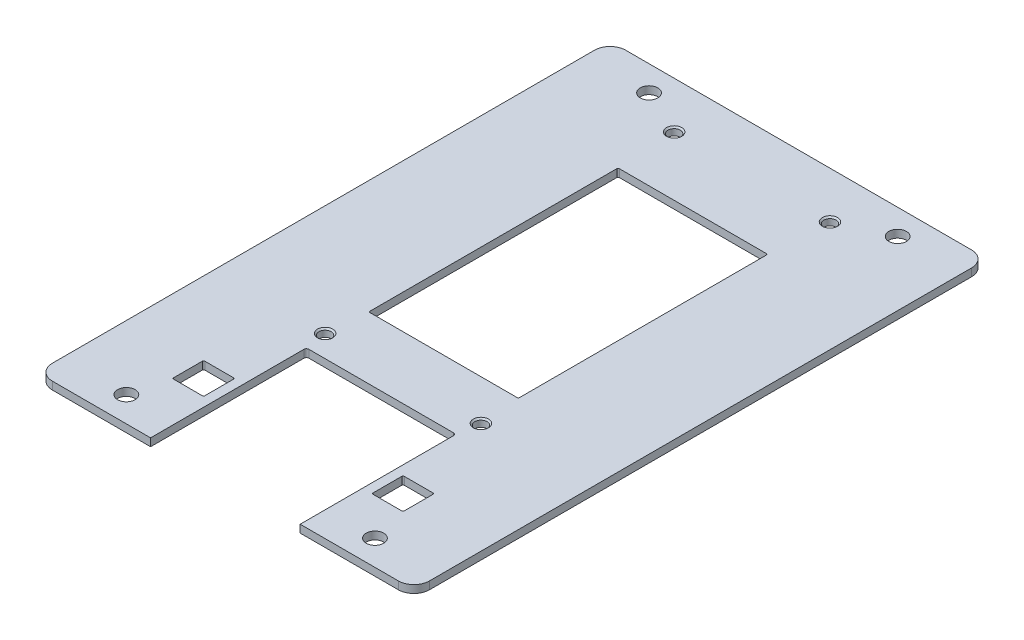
ISO-10303-21;
HEADER;
FILE_DESCRIPTION(('STEP AP214'),'2;1');
FILE_NAME('part.step','',(''),(''),'','','');
FILE_SCHEMA(('AUTOMOTIVE_DESIGN { 1 0 10303 214 1 1 1 1 }'));
ENDSEC;
DATA;
#1=APPLICATION_CONTEXT('core data for automotive mechanical design processes');
#2=APPLICATION_PROTOCOL_DEFINITION('international standard','automotive_design',2000,#1);
#3=PRODUCT_CONTEXT('',#1,'mechanical');
#4=PRODUCT('Part','Part','',(#3));
#5=PRODUCT_RELATED_PRODUCT_CATEGORY('part','',(#4));
#6=PRODUCT_DEFINITION_FORMATION('','',#4);
#7=PRODUCT_DEFINITION_CONTEXT('part definition',#1,'design');
#8=PRODUCT_DEFINITION('design','',#6,#7);
#9=PRODUCT_DEFINITION_SHAPE('','',#8);
#10=(LENGTH_UNIT() NAMED_UNIT(*) SI_UNIT(.MILLI.,.METRE.));
#11=(NAMED_UNIT(*) PLANE_ANGLE_UNIT() SI_UNIT($,.RADIAN.));
#12=(NAMED_UNIT(*) SI_UNIT($,.STERADIAN.) SOLID_ANGLE_UNIT());
#13=UNCERTAINTY_MEASURE_WITH_UNIT(LENGTH_MEASURE(1.E-05),#10,'distance_accuracy_value','');
#14=(GEOMETRIC_REPRESENTATION_CONTEXT(3) GLOBAL_UNCERTAINTY_ASSIGNED_CONTEXT((#13)) GLOBAL_UNIT_ASSIGNED_CONTEXT((#10,
#11,#12)) REPRESENTATION_CONTEXT('',''));
#15=CARTESIAN_POINT('',(0.,0.,0.));
#16=DIRECTION('',(0.,0.,1.));
#17=DIRECTION('',(1.,0.,0.));
#18=AXIS2_PLACEMENT_3D('',#15,#16,#17);
#19=CARTESIAN_POINT('',(38.4161499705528,-0.787399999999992,58.4));
#20=DIRECTION('',(0.,0.,1.));
#21=DIRECTION('',(1.,0.,0.));
#22=AXIS2_PLACEMENT_3D('',#19,#20,#21);
#23=PLANE('',#22);
#24=DIRECTION('',(0.,1.,0.));
#25=VECTOR('',#24,1.);
#26=CARTESIAN_POINT('',(15.24,-0.787399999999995,58.4));
#27=LINE('',#26,#25);
#28=CARTESIAN_POINT('',(15.24,-0.787400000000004,58.4));
#29=VERTEX_POINT('',#28);
#30=CARTESIAN_POINT('',(15.24,0.787400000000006,58.4));
#31=VERTEX_POINT('',#30);
#32=EDGE_CURVE('E287',#29,#31,#27,.T.);
#33=ORIENTED_EDGE('',*,*,#32,.F.);
#34=DIRECTION('',(1.,0.,0.));
#35=VECTOR('',#34,1.);
#36=CARTESIAN_POINT('',(-38.4161499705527,-0.787400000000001,58.4));
#37=LINE('',#36,#35);
#38=CARTESIAN_POINT('',(35.2411499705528,-0.78739999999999,58.4));
#39=VERTEX_POINT('',#38);
#40=EDGE_CURVE('E504',#29,#39,#37,.T.);
#41=ORIENTED_EDGE('',*,*,#40,.T.);
#42=DIRECTION('',(0.,1.,0.));
#43=VECTOR('',#42,1.);
#44=CARTESIAN_POINT('',(35.2411499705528,0.787400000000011,58.4));
#45=LINE('',#44,#43);
#46=CARTESIAN_POINT('',(35.2411499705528,0.787400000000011,58.4));
#47=VERTEX_POINT('',#46);
#48=EDGE_CURVE('E523',#39,#47,#45,.T.);
#49=ORIENTED_EDGE('',*,*,#48,.T.);
#50=DIRECTION('',(-1.,0.,0.));
#51=VECTOR('',#50,1.);
#52=CARTESIAN_POINT('',(-38.4161499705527,0.787400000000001,58.4));
#53=LINE('',#52,#51);
#54=EDGE_CURVE('E509',#47,#31,#53,.T.);
#55=ORIENTED_EDGE('',*,*,#54,.T.);
#56=EDGE_LOOP('',(#33,#41,#49,#55));
#57=FACE_BOUND('',#56,.T.);
#58=ADVANCED_FACE('F36',(#57),#23,.T.);
#59=CARTESIAN_POINT('',(-38.4161499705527,-0.787400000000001,58.4));
#60=DIRECTION('',(0.,1.,0.));
#61=DIRECTION('',(-1.,0.,0.));
#62=AXIS2_PLACEMENT_3D('',#59,#60,#61);
#63=PLANE('',#62);
#64=DIRECTION('',(0.,0.,-1.));
#65=VECTOR('',#64,1.);
#66=CARTESIAN_POINT('',(15.24,-0.787400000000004,13.95));
#67=LINE('',#66,#65);
#68=CARTESIAN_POINT('',(15.24,-0.787400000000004,13.696));
#69=VERTEX_POINT('',#68);
#70=CARTESIAN_POINT('',(15.24,-0.787400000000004,-36.596));
#71=VERTEX_POINT('',#70);
#72=EDGE_CURVE('E644',#69,#71,#67,.T.);
#73=ORIENTED_EDGE('',*,*,#72,.T.);
#74=CARTESIAN_POINT('',(14.986,-0.787399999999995,-36.596));
#75=DIRECTION('',(0.,1.,0.));
#76=DIRECTION('',(-1.,0.,0.));
#77=AXIS2_PLACEMENT_3D('',#74,#75,#76);
#78=CIRCLE('',#77,0.254);
#79=CARTESIAN_POINT('',(14.986,-0.787400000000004,-36.85));
#80=VERTEX_POINT('',#79);
#81=EDGE_CURVE('E58',#71,#80,#78,.T.);
#82=ORIENTED_EDGE('',*,*,#81,.T.);
#83=DIRECTION('',(-1.,0.,0.));
#84=VECTOR('',#83,1.);
#85=CARTESIAN_POINT('',(-15.24,-0.787400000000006,-36.85));
#86=LINE('',#85,#84);
#87=CARTESIAN_POINT('',(-14.986,-0.787400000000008,-36.85));
#88=VERTEX_POINT('',#87);
#89=EDGE_CURVE('E293',#80,#88,#86,.T.);
#90=ORIENTED_EDGE('',*,*,#89,.T.);
#91=CARTESIAN_POINT('',(-14.986,-0.787399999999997,-36.596));
#92=DIRECTION('',(0.,1.,0.));
#93=DIRECTION('',(-1.,0.,0.));
#94=AXIS2_PLACEMENT_3D('',#91,#92,#93);
#95=CIRCLE('',#94,0.254);
#96=CARTESIAN_POINT('',(-15.24,-0.787400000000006,-36.596));
#97=VERTEX_POINT('',#96);
#98=EDGE_CURVE('E11',#88,#97,#95,.T.);
#99=ORIENTED_EDGE('',*,*,#98,.T.);
#100=DIRECTION('',(0.,0.,1.));
#101=VECTOR('',#100,1.);
#102=CARTESIAN_POINT('',(-15.24,-0.787400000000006,13.95));
#103=LINE('',#102,#101);
#104=CARTESIAN_POINT('',(-15.24,-0.787400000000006,13.696));
#105=VERTEX_POINT('',#104);
#106=EDGE_CURVE('E629',#97,#105,#103,.T.);
#107=ORIENTED_EDGE('',*,*,#106,.T.);
#108=CARTESIAN_POINT('',(-14.986,-0.787399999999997,13.696));
#109=DIRECTION('',(0.,1.,0.));
#110=DIRECTION('',(-1.,0.,0.));
#111=AXIS2_PLACEMENT_3D('',#108,#109,#110);
#112=CIRCLE('',#111,0.254);
#113=CARTESIAN_POINT('',(-14.986,-0.787400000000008,13.95));
#114=VERTEX_POINT('',#113);
#115=EDGE_CURVE('E613',#105,#114,#112,.T.);
#116=ORIENTED_EDGE('',*,*,#115,.T.);
#117=DIRECTION('',(1.,0.,0.));
#118=VECTOR('',#117,1.);
#119=CARTESIAN_POINT('',(-15.24,-0.787400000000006,13.95));
#120=LINE('',#119,#118);
#121=CARTESIAN_POINT('',(14.986,-0.787400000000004,13.95));
#122=VERTEX_POINT('',#121);
#123=EDGE_CURVE('E641',#114,#122,#120,.T.);
#124=ORIENTED_EDGE('',*,*,#123,.T.);
#125=CARTESIAN_POINT('',(14.986,-0.787399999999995,13.696));
#126=DIRECTION('',(0.,1.,0.));
#127=DIRECTION('',(-1.,0.,0.));
#128=AXIS2_PLACEMENT_3D('',#125,#126,#127);
#129=CIRCLE('',#128,0.254);
#130=EDGE_CURVE('E609',#122,#69,#129,.T.);
#131=ORIENTED_EDGE('',*,*,#130,.T.);
#132=EDGE_LOOP('',(#73,#82,#90,#99,#107,#116,#124,#131));
#133=FACE_BOUND('',#132,.T.);
#134=ORIENTED_EDGE('',*,*,#40,.F.);
#135=DIRECTION('',(0.,0.,-1.));
#136=VECTOR('',#135,1.);
#137=CARTESIAN_POINT('',(15.24,-0.787400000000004,61.0309990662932));
#138=LINE('',#137,#136);
#139=CARTESIAN_POINT('',(15.24,-0.787400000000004,27.158));
#140=VERTEX_POINT('',#139);
#141=EDGE_CURVE('E318',#29,#140,#138,.T.);
#142=ORIENTED_EDGE('',*,*,#141,.T.);
#143=CARTESIAN_POINT('',(14.732,-0.787400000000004,27.158));
#144=DIRECTION('',(0.,1.,0.));
#145=DIRECTION('',(1.,0.,0.));
#146=AXIS2_PLACEMENT_3D('',#143,#144,#145);
#147=CIRCLE('',#146,0.507999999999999);
#148=CARTESIAN_POINT('',(14.732,-0.787400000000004,26.65));
#149=VERTEX_POINT('',#148);
#150=EDGE_CURVE('E300',#140,#149,#147,.T.);
#151=ORIENTED_EDGE('',*,*,#150,.T.);
#152=DIRECTION('',(-1.,0.,0.));
#153=VECTOR('',#152,1.);
#154=CARTESIAN_POINT('',(14.732,-0.787400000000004,26.65));
#155=LINE('',#154,#153);
#156=CARTESIAN_POINT('',(-14.732,-0.787400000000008,26.65));
#157=VERTEX_POINT('',#156);
#158=EDGE_CURVE('E321',#149,#157,#155,.T.);
#159=ORIENTED_EDGE('',*,*,#158,.T.);
#160=CARTESIAN_POINT('',(-14.732,-0.787400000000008,27.158));
#161=DIRECTION('',(0.,1.,0.));
#162=DIRECTION('',(1.,0.,0.));
#163=AXIS2_PLACEMENT_3D('',#160,#161,#162);
#164=CIRCLE('',#163,0.507999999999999);
#165=CARTESIAN_POINT('',(-15.24,-0.787400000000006,27.158));
#166=VERTEX_POINT('',#165);
#167=EDGE_CURVE('E324',#157,#166,#164,.T.);
#168=ORIENTED_EDGE('',*,*,#167,.T.);
#169=DIRECTION('',(0.,0.,1.));
#170=VECTOR('',#169,1.);
#171=CARTESIAN_POINT('',(-15.24,-0.787400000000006,61.0309990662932));
#172=LINE('',#171,#170);
#173=CARTESIAN_POINT('',(-15.24,-0.787400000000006,58.4));
#174=VERTEX_POINT('',#173);
#175=EDGE_CURVE('E303',#166,#174,#172,.T.);
#176=ORIENTED_EDGE('',*,*,#175,.T.);
#177=CARTESIAN_POINT('',(-35.2411499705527,-0.787400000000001,58.4));
#178=VERTEX_POINT('',#177);
#179=EDGE_CURVE('E505',#178,#174,#37,.T.);
#180=ORIENTED_EDGE('',*,*,#179,.F.);
#181=CARTESIAN_POINT('',(-35.2411499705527,-0.787400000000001,55.225));
#182=DIRECTION('',(0.,1.,0.));
#183=DIRECTION('',(-1.,0.,0.));
#184=AXIS2_PLACEMENT_3D('',#181,#182,#183);
#185=CIRCLE('',#184,3.175);
#186=CARTESIAN_POINT('',(-38.4161499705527,-0.787400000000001,55.225));
#187=VERTEX_POINT('',#186);
#188=EDGE_CURVE('E536',#178,#187,#185,.F.);
#189=ORIENTED_EDGE('',*,*,#188,.T.);
#190=DIRECTION('',(0.,0.,-1.));
#191=VECTOR('',#190,1.);
#192=CARTESIAN_POINT('',(-38.4161499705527,-0.787400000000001,58.4));
#193=LINE('',#192,#191);
#194=CARTESIAN_POINT('',(-38.4161499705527,-0.787400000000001,-55.225));
#195=VERTEX_POINT('',#194);
#196=EDGE_CURVE('E511',#187,#195,#193,.T.);
#197=ORIENTED_EDGE('',*,*,#196,.T.);
#198=CARTESIAN_POINT('',(-35.2411499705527,-0.787400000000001,-55.225));
#199=DIRECTION('',(0.,1.,0.));
#200=DIRECTION('',(-1.,0.,0.));
#201=AXIS2_PLACEMENT_3D('',#198,#199,#200);
#202=CIRCLE('',#201,3.175);
#203=CARTESIAN_POINT('',(-35.2411499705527,-0.787400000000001,-58.4));
#204=VERTEX_POINT('',#203);
#205=EDGE_CURVE('E529',#195,#204,#202,.F.);
#206=ORIENTED_EDGE('',*,*,#205,.T.);
#207=DIRECTION('',(1.,0.,0.));
#208=VECTOR('',#207,1.);
#209=CARTESIAN_POINT('',(-38.4161499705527,-0.787400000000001,-58.4));
#210=LINE('',#209,#208);
#211=CARTESIAN_POINT('',(35.2411499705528,-0.78739999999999,-58.4));
#212=VERTEX_POINT('',#211);
#213=EDGE_CURVE('E498',#204,#212,#210,.T.);
#214=ORIENTED_EDGE('',*,*,#213,.T.);
#215=CARTESIAN_POINT('',(35.2411499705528,-0.78739999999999,-55.225));
#216=DIRECTION('',(0.,1.,0.));
#217=DIRECTION('',(-1.,0.,0.));
#218=AXIS2_PLACEMENT_3D('',#215,#216,#217);
#219=CIRCLE('',#218,3.175);
#220=CARTESIAN_POINT('',(38.4161499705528,-0.787399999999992,-55.225));
#221=VERTEX_POINT('',#220);
#222=EDGE_CURVE('E531',#212,#221,#219,.F.);
#223=ORIENTED_EDGE('',*,*,#222,.T.);
#224=DIRECTION('',(0.,0.,-1.));
#225=VECTOR('',#224,1.);
#226=CARTESIAN_POINT('',(38.4161499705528,-0.787399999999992,58.4));
#227=LINE('',#226,#225);
#228=CARTESIAN_POINT('',(38.4161499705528,-0.787399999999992,55.225));
#229=VERTEX_POINT('',#228);
#230=EDGE_CURVE('E520',#229,#221,#227,.T.);
#231=ORIENTED_EDGE('',*,*,#230,.F.);
#232=CARTESIAN_POINT('',(35.2411499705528,-0.78739999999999,55.225));
#233=DIRECTION('',(0.,1.,0.));
#234=DIRECTION('',(-1.,0.,0.));
#235=AXIS2_PLACEMENT_3D('',#232,#233,#234);
#236=CIRCLE('',#235,3.175);
#237=EDGE_CURVE('E533',#229,#39,#236,.F.);
#238=ORIENTED_EDGE('',*,*,#237,.T.);
#239=EDGE_LOOP('',(#134,#142,#151,#159,#168,#176,#180,#189,#197,#206,#214,#223,#231,#238));
#240=FACE_BOUND('',#239,.T.);
#241=DIRECTION('',(-1.,0.,0.));
#242=VECTOR('',#241,1.);
#243=CARTESIAN_POINT('',(-38.4161499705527,-0.787400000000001,39.35));
#244=LINE('',#243,#242);
#245=CARTESIAN_POINT('',(23.241,-0.787399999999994,39.35));
#246=VERTEX_POINT('',#245);
#247=CARTESIAN_POINT('',(17.399,-0.787399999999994,39.35));
#248=VERTEX_POINT('',#247);
#249=EDGE_CURVE('E392',#246,#248,#244,.T.);
#250=ORIENTED_EDGE('',*,*,#249,.T.);
#251=CARTESIAN_POINT('',(17.399,-0.787399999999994,39.604));
#252=DIRECTION('',(0.,1.,0.));
#253=DIRECTION('',(-1.,0.,0.));
#254=AXIS2_PLACEMENT_3D('',#251,#252,#253);
#255=CIRCLE('',#254,0.253999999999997);
#256=CARTESIAN_POINT('',(17.145,-0.787399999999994,39.604));
#257=VERTEX_POINT('',#256);
#258=EDGE_CURVE('E395',#248,#257,#255,.T.);
#259=ORIENTED_EDGE('',*,*,#258,.T.);
#260=DIRECTION('',(0.,0.,1.));
#261=VECTOR('',#260,1.);
#262=CARTESIAN_POINT('',(17.145,-0.787399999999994,58.4000000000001));
#263=LINE('',#262,#261);
#264=CARTESIAN_POINT('',(17.145,-0.787399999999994,45.446));
#265=VERTEX_POINT('',#264);
#266=EDGE_CURVE('E360',#257,#265,#263,.T.);
#267=ORIENTED_EDGE('',*,*,#266,.T.);
#268=CARTESIAN_POINT('',(17.399,-0.787399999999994,45.446));
#269=DIRECTION('',(0.,1.,0.));
#270=DIRECTION('',(-1.,0.,0.));
#271=AXIS2_PLACEMENT_3D('',#268,#269,#270);
#272=CIRCLE('',#271,0.254000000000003);
#273=CARTESIAN_POINT('',(17.399,-0.787399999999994,45.7));
#274=VERTEX_POINT('',#273);
#275=EDGE_CURVE('E377',#265,#274,#272,.T.);
#276=ORIENTED_EDGE('',*,*,#275,.T.);
#277=DIRECTION('',(1.,0.,0.));
#278=VECTOR('',#277,1.);
#279=CARTESIAN_POINT('',(-38.4161499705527,-0.787400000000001,45.7));
#280=LINE('',#279,#278);
#281=CARTESIAN_POINT('',(23.241,-0.787399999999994,45.7));
#282=VERTEX_POINT('',#281);
#283=EDGE_CURVE('E380',#274,#282,#280,.T.);
#284=ORIENTED_EDGE('',*,*,#283,.T.);
#285=CARTESIAN_POINT('',(23.241,-0.787399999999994,45.446));
#286=DIRECTION('',(0.,1.,0.));
#287=DIRECTION('',(-1.,0.,0.));
#288=AXIS2_PLACEMENT_3D('',#285,#286,#287);
#289=CIRCLE('',#288,0.253999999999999);
#290=CARTESIAN_POINT('',(23.495,-0.787399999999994,45.446));
#291=VERTEX_POINT('',#290);
#292=EDGE_CURVE('E383',#282,#291,#289,.T.);
#293=ORIENTED_EDGE('',*,*,#292,.T.);
#294=DIRECTION('',(0.,0.,-1.));
#295=VECTOR('',#294,1.);
#296=CARTESIAN_POINT('',(23.495,-0.787399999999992,58.4));
#297=LINE('',#296,#295);
#298=CARTESIAN_POINT('',(23.495,-0.787399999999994,39.604));
#299=VERTEX_POINT('',#298);
#300=EDGE_CURVE('E386',#291,#299,#297,.T.);
#301=ORIENTED_EDGE('',*,*,#300,.T.);
#302=CARTESIAN_POINT('',(23.241,-0.787399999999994,39.604));
#303=DIRECTION('',(0.,1.,0.));
#304=DIRECTION('',(-1.,0.,0.));
#305=AXIS2_PLACEMENT_3D('',#302,#303,#304);
#306=CIRCLE('',#305,0.253999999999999);
#307=EDGE_CURVE('E389',#299,#246,#306,.T.);
#308=ORIENTED_EDGE('',*,*,#307,.T.);
#309=EDGE_LOOP('',(#250,#259,#267,#276,#284,#293,#301,#308));
#310=FACE_BOUND('',#309,.T.);
#311=DIRECTION('',(0.,0.,1.));
#312=VECTOR('',#311,1.);
#313=CARTESIAN_POINT('',(-23.495,-0.787399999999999,58.4));
#314=LINE('',#313,#312);
#315=CARTESIAN_POINT('',(-23.495,-0.787399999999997,39.604));
#316=VERTEX_POINT('',#315);
#317=CARTESIAN_POINT('',(-23.495,-0.787399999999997,45.446));
#318=VERTEX_POINT('',#317);
#319=EDGE_CURVE('E456',#316,#318,#314,.T.);
#320=ORIENTED_EDGE('',*,*,#319,.T.);
#321=CARTESIAN_POINT('',(-23.241,-0.787399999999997,45.446));
#322=DIRECTION('',(0.,1.,0.));
#323=DIRECTION('',(-1.,0.,0.));
#324=AXIS2_PLACEMENT_3D('',#321,#322,#323);
#325=CIRCLE('',#324,0.253999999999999);
#326=CARTESIAN_POINT('',(-23.241,-0.787399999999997,45.7));
#327=VERTEX_POINT('',#326);
#328=EDGE_CURVE('E459',#318,#327,#325,.T.);
#329=ORIENTED_EDGE('',*,*,#328,.T.);
#330=DIRECTION('',(1.,0.,0.));
#331=VECTOR('',#330,1.);
#332=CARTESIAN_POINT('',(-38.4161499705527,-0.787400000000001,45.7));
#333=LINE('',#332,#331);
#334=CARTESIAN_POINT('',(-17.399,-0.787399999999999,45.7));
#335=VERTEX_POINT('',#334);
#336=EDGE_CURVE('E424',#327,#335,#333,.T.);
#337=ORIENTED_EDGE('',*,*,#336,.T.);
#338=CARTESIAN_POINT('',(-17.399,-0.787399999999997,45.446));
#339=DIRECTION('',(0.,1.,0.));
#340=DIRECTION('',(-1.,0.,0.));
#341=AXIS2_PLACEMENT_3D('',#338,#339,#340);
#342=CIRCLE('',#341,0.254000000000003);
#343=CARTESIAN_POINT('',(-17.145,-0.787399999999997,45.446));
#344=VERTEX_POINT('',#343);
#345=EDGE_CURVE('E441',#335,#344,#342,.T.);
#346=ORIENTED_EDGE('',*,*,#345,.T.);
#347=DIRECTION('',(0.,0.,-1.));
#348=VECTOR('',#347,1.);
#349=CARTESIAN_POINT('',(-17.145,-0.787399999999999,58.4));
#350=LINE('',#349,#348);
#351=CARTESIAN_POINT('',(-17.145,-0.787399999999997,39.604));
#352=VERTEX_POINT('',#351);
#353=EDGE_CURVE('E444',#344,#352,#350,.T.);
#354=ORIENTED_EDGE('',*,*,#353,.T.);
#355=CARTESIAN_POINT('',(-17.399,-0.787399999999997,39.604));
#356=DIRECTION('',(0.,1.,0.));
#357=DIRECTION('',(-1.,0.,0.));
#358=AXIS2_PLACEMENT_3D('',#355,#356,#357);
#359=CIRCLE('',#358,0.253999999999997);
#360=CARTESIAN_POINT('',(-17.399,-0.787399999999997,39.35));
#361=VERTEX_POINT('',#360);
#362=EDGE_CURVE('E447',#352,#361,#359,.T.);
#363=ORIENTED_EDGE('',*,*,#362,.T.);
#364=DIRECTION('',(-1.,0.,0.));
#365=VECTOR('',#364,1.);
#366=CARTESIAN_POINT('',(-38.4161499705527,-0.787400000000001,39.35));
#367=LINE('',#366,#365);
#368=CARTESIAN_POINT('',(-23.241,-0.787399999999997,39.35));
#369=VERTEX_POINT('',#368);
#370=EDGE_CURVE('E450',#361,#369,#367,.T.);
#371=ORIENTED_EDGE('',*,*,#370,.T.);
#372=CARTESIAN_POINT('',(-23.241,-0.787399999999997,39.604));
#373=DIRECTION('',(0.,1.,0.));
#374=DIRECTION('',(-1.,0.,0.));
#375=AXIS2_PLACEMENT_3D('',#372,#373,#374);
#376=CIRCLE('',#375,0.253999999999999);
#377=EDGE_CURVE('E453',#369,#316,#376,.T.);
#378=ORIENTED_EDGE('',*,*,#377,.T.);
#379=EDGE_LOOP('',(#320,#329,#337,#346,#354,#363,#371,#378));
#380=FACE_BOUND('',#379,.T.);
#381=CARTESIAN_POINT('',(-15.875,-0.787399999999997,-48.915));
#382=DIRECTION('',(0.,1.,0.));
#383=DIRECTION('',(-1.,0.,0.));
#384=AXIS2_PLACEMENT_3D('',#381,#382,#383);
#385=CIRCLE('',#384,1.25);
#386=CARTESIAN_POINT('',(-17.125,-0.787399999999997,-48.915));
#387=VERTEX_POINT('',#386);
#388=EDGE_CURVE('E462',#387,#387,#385,.T.);
#389=ORIENTED_EDGE('',*,*,#388,.T.);
#390=EDGE_LOOP('',(#389));
#391=FACE_BOUND('',#390,.T.);
#392=CARTESIAN_POINT('',(-15.875,-0.787399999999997,22.205));
#393=DIRECTION('',(0.,1.,0.));
#394=DIRECTION('',(-1.,0.,0.));
#395=AXIS2_PLACEMENT_3D('',#392,#393,#394);
#396=CIRCLE('',#395,1.25);
#397=CARTESIAN_POINT('',(-17.125,-0.787399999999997,22.205));
#398=VERTEX_POINT('',#397);
#399=EDGE_CURVE('E465',#398,#398,#396,.T.);
#400=ORIENTED_EDGE('',*,*,#399,.T.);
#401=EDGE_LOOP('',(#400));
#402=FACE_BOUND('',#401,.T.);
#403=CARTESIAN_POINT('',(15.875,-0.787399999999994,-48.915));
#404=DIRECTION('',(0.,1.,0.));
#405=DIRECTION('',(-1.,0.,0.));
#406=AXIS2_PLACEMENT_3D('',#403,#404,#405);
#407=CIRCLE('',#406,1.25);
#408=CARTESIAN_POINT('',(14.625,-0.787399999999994,-48.915));
#409=VERTEX_POINT('',#408);
#410=EDGE_CURVE('E468',#409,#409,#407,.T.);
#411=ORIENTED_EDGE('',*,*,#410,.T.);
#412=EDGE_LOOP('',(#411));
#413=FACE_BOUND('',#412,.T.);
#414=CARTESIAN_POINT('',(15.875,-0.787399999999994,22.205));
#415=DIRECTION('',(0.,1.,0.));
#416=DIRECTION('',(-1.,0.,0.));
#417=AXIS2_PLACEMENT_3D('',#414,#415,#416);
#418=CIRCLE('',#417,1.25);
#419=CARTESIAN_POINT('',(14.625,-0.787399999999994,22.205));
#420=VERTEX_POINT('',#419);
#421=EDGE_CURVE('E471',#420,#420,#418,.T.);
#422=ORIENTED_EDGE('',*,*,#421,.T.);
#423=EDGE_LOOP('',(#422));
#424=FACE_BOUND('',#423,.T.);
#425=CARTESIAN_POINT('',(25.325,-0.787399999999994,53.25));
#426=DIRECTION('',(0.,1.,0.));
#427=DIRECTION('',(-1.,0.,0.));
#428=AXIS2_PLACEMENT_3D('',#425,#426,#427);
#429=CIRCLE('',#428,1.7859375);
#430=CARTESIAN_POINT('',(23.5390625,-0.787399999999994,53.25));
#431=VERTEX_POINT('',#430);
#432=EDGE_CURVE('E477',#431,#431,#429,.T.);
#433=ORIENTED_EDGE('',*,*,#432,.T.);
#434=EDGE_LOOP('',(#433));
#435=FACE_BOUND('',#434,.T.);
#436=CARTESIAN_POINT('',(-25.325,-0.787400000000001,53.25));
#437=DIRECTION('',(0.,1.,0.));
#438=DIRECTION('',(-1.,0.,0.));
#439=AXIS2_PLACEMENT_3D('',#436,#437,#438);
#440=CIRCLE('',#439,1.7859375);
#441=CARTESIAN_POINT('',(-27.1109375,-0.787400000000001,53.25));
#442=VERTEX_POINT('',#441);
#443=EDGE_CURVE('E483',#442,#442,#440,.T.);
#444=ORIENTED_EDGE('',*,*,#443,.T.);
#445=EDGE_LOOP('',(#444));
#446=FACE_BOUND('',#445,.T.);
#447=CARTESIAN_POINT('',(25.325,-0.787399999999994,-53.25));
#448=DIRECTION('',(0.,1.,0.));
#449=DIRECTION('',(-1.,0.,0.));
#450=AXIS2_PLACEMENT_3D('',#447,#448,#449);
#451=CIRCLE('',#450,1.7859375);
#452=CARTESIAN_POINT('',(23.5390625,-0.787399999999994,-53.25));
#453=VERTEX_POINT('',#452);
#454=EDGE_CURVE('E489',#453,#453,#451,.T.);
#455=ORIENTED_EDGE('',*,*,#454,.T.);
#456=EDGE_LOOP('',(#455));
#457=FACE_BOUND('',#456,.T.);
#458=CARTESIAN_POINT('',(-25.325,-0.787400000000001,-53.25));
#459=DIRECTION('',(0.,1.,0.));
#460=DIRECTION('',(-1.,0.,0.));
#461=AXIS2_PLACEMENT_3D('',#458,#459,#460);
#462=CIRCLE('',#461,1.7859375);
#463=CARTESIAN_POINT('',(-27.1109375,-0.787400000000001,-53.25));
#464=VERTEX_POINT('',#463);
#465=EDGE_CURVE('E495',#464,#464,#462,.T.);
#466=ORIENTED_EDGE('',*,*,#465,.T.);
#467=EDGE_LOOP('',(#466));
#468=FACE_BOUND('',#467,.T.);
#469=ADVANCED_FACE('F38',(#133,#240,#310,#380,#391,#402,#413,#424,#435,#446,#457,#468),#63,.F.);
#470=CARTESIAN_POINT('',(38.4161499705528,-0.787399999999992,58.4));
#471=DIRECTION('',(-1.,0.,0.));
#472=DIRECTION('',(0.,0.,1.));
#473=AXIS2_PLACEMENT_3D('',#470,#471,#472);
#474=PLANE('',#473);
#475=DIRECTION('',(0.,0.,-1.));
#476=VECTOR('',#475,1.);
#477=CARTESIAN_POINT('',(38.4161499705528,0.787400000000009,58.4));
#478=LINE('',#477,#476);
#479=CARTESIAN_POINT('',(38.4161499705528,0.787400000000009,55.225));
#480=VERTEX_POINT('',#479);
#481=CARTESIAN_POINT('',(38.4161499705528,0.787400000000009,-55.225));
#482=VERTEX_POINT('',#481);
#483=EDGE_CURVE('E517',#480,#482,#478,.T.);
#484=ORIENTED_EDGE('',*,*,#483,.F.);
#485=DIRECTION('',(0.,1.,0.));
#486=VECTOR('',#485,1.);
#487=CARTESIAN_POINT('',(38.4161499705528,-0.787399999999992,55.225));
#488=LINE('',#487,#486);
#489=EDGE_CURVE('E555',#480,#229,#488,.F.);
#490=ORIENTED_EDGE('',*,*,#489,.T.);
#491=ORIENTED_EDGE('',*,*,#230,.T.);
#492=DIRECTION('',(0.,1.,0.));
#493=VECTOR('',#492,1.);
#494=CARTESIAN_POINT('',(38.4161499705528,-0.787399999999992,-55.225));
#495=LINE('',#494,#493);
#496=EDGE_CURVE('E552',#221,#482,#495,.T.);
#497=ORIENTED_EDGE('',*,*,#496,.T.);
#498=EDGE_LOOP('',(#484,#490,#491,#497));
#499=FACE_BOUND('',#498,.T.);
#500=ADVANCED_FACE('F687',(#499),#474,.F.);
#501=CARTESIAN_POINT('',(-38.4161499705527,0.787400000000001,58.4));
#502=DIRECTION('',(0.,-1.,0.));
#503=DIRECTION('',(1.,0.,0.));
#504=AXIS2_PLACEMENT_3D('',#501,#502,#503);
#505=PLANE('',#504);
#506=DIRECTION('',(1.,0.,0.));
#507=VECTOR('',#506,1.);
#508=CARTESIAN_POINT('',(-15.24,0.787400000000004,13.95));
#509=LINE('',#508,#507);
#510=CARTESIAN_POINT('',(-14.986,0.787400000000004,13.95));
#511=VERTEX_POINT('',#510);
#512=CARTESIAN_POINT('',(14.986,0.787400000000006,13.95));
#513=VERTEX_POINT('',#512);
#514=EDGE_CURVE('E658',#511,#513,#509,.T.);
#515=ORIENTED_EDGE('',*,*,#514,.F.);
#516=CARTESIAN_POINT('',(-14.986,0.787400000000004,13.696));
#517=DIRECTION('',(0.,-1.,0.));
#518=DIRECTION('',(1.,0.,0.));
#519=AXIS2_PLACEMENT_3D('',#516,#517,#518);
#520=CIRCLE('',#519,0.254);
#521=CARTESIAN_POINT('',(-15.24,0.787400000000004,13.696));
#522=VERTEX_POINT('',#521);
#523=EDGE_CURVE('E611',#511,#522,#520,.T.);
#524=ORIENTED_EDGE('',*,*,#523,.T.);
#525=DIRECTION('',(0.,0.,1.));
#526=VECTOR('',#525,1.);
#527=CARTESIAN_POINT('',(-15.24,0.787400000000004,13.95));
#528=LINE('',#527,#526);
#529=CARTESIAN_POINT('',(-15.24,0.787400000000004,-36.596));
#530=VERTEX_POINT('',#529);
#531=EDGE_CURVE('E624',#530,#522,#528,.T.);
#532=ORIENTED_EDGE('',*,*,#531,.F.);
#533=CARTESIAN_POINT('',(-14.986,0.787400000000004,-36.596));
#534=DIRECTION('',(0.,-1.,0.));
#535=DIRECTION('',(1.,0.,0.));
#536=AXIS2_PLACEMENT_3D('',#533,#534,#535);
#537=CIRCLE('',#536,0.254);
#538=CARTESIAN_POINT('',(-14.986,0.787400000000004,-36.85));
#539=VERTEX_POINT('',#538);
#540=EDGE_CURVE('E44',#530,#539,#537,.T.);
#541=ORIENTED_EDGE('',*,*,#540,.T.);
#542=DIRECTION('',(-1.,0.,0.));
#543=VECTOR('',#542,1.);
#544=CARTESIAN_POINT('',(-15.24,0.787400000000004,-36.85));
#545=LINE('',#544,#543);
#546=CARTESIAN_POINT('',(14.986,0.787400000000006,-36.85));
#547=VERTEX_POINT('',#546);
#548=EDGE_CURVE('E622',#547,#539,#545,.T.);
#549=ORIENTED_EDGE('',*,*,#548,.F.);
#550=CARTESIAN_POINT('',(14.986,0.787400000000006,-36.596));
#551=DIRECTION('',(0.,-1.,0.));
#552=DIRECTION('',(1.,0.,0.));
#553=AXIS2_PLACEMENT_3D('',#550,#551,#552);
#554=CIRCLE('',#553,0.254);
#555=CARTESIAN_POINT('',(15.24,0.787400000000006,-36.596));
#556=VERTEX_POINT('',#555);
#557=EDGE_CURVE('E615',#547,#556,#554,.T.);
#558=ORIENTED_EDGE('',*,*,#557,.T.);
#559=DIRECTION('',(0.,0.,-1.));
#560=VECTOR('',#559,1.);
#561=CARTESIAN_POINT('',(15.24,0.787400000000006,13.95));
#562=LINE('',#561,#560);
#563=CARTESIAN_POINT('',(15.24,0.787400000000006,13.696));
#564=VERTEX_POINT('',#563);
#565=EDGE_CURVE('E630',#564,#556,#562,.T.);
#566=ORIENTED_EDGE('',*,*,#565,.F.);
#567=CARTESIAN_POINT('',(14.986,0.787400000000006,13.696));
#568=DIRECTION('',(0.,-1.,0.));
#569=DIRECTION('',(1.,0.,0.));
#570=AXIS2_PLACEMENT_3D('',#567,#568,#569);
#571=CIRCLE('',#570,0.254);
#572=EDGE_CURVE('E607',#564,#513,#571,.T.);
#573=ORIENTED_EDGE('',*,*,#572,.T.);
#574=EDGE_LOOP('',(#515,#524,#532,#541,#549,#558,#566,#573));
#575=FACE_BOUND('',#574,.T.);
#576=CARTESIAN_POINT('',(15.875,0.787400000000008,-48.915));
#577=DIRECTION('',(0.,-1.,0.));
#578=DIRECTION('',(1.,0.,0.));
#579=AXIS2_PLACEMENT_3D('',#576,#577,#578);
#580=CIRCLE('',#579,1.55);
#581=CARTESIAN_POINT('',(17.425,0.787400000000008,-48.915));
#582=VERTEX_POINT('',#581);
#583=EDGE_CURVE('E573',#582,#582,#580,.T.);
#584=ORIENTED_EDGE('',*,*,#583,.T.);
#585=EDGE_LOOP('',(#584));
#586=FACE_BOUND('',#585,.T.);
#587=CARTESIAN_POINT('',(-15.875,0.787400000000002,-48.915));
#588=DIRECTION('',(0.,-1.,0.));
#589=DIRECTION('',(1.,0.,0.));
#590=AXIS2_PLACEMENT_3D('',#587,#588,#589);
#591=CIRCLE('',#590,1.55);
#592=CARTESIAN_POINT('',(-14.325,0.787400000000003,-48.915));
#593=VERTEX_POINT('',#592);
#594=EDGE_CURVE('E570',#593,#593,#591,.T.);
#595=ORIENTED_EDGE('',*,*,#594,.T.);
#596=EDGE_LOOP('',(#595));
#597=FACE_BOUND('',#596,.T.);
#598=CARTESIAN_POINT('',(-15.875,0.787400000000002,22.205));
#599=DIRECTION('',(0.,-1.,0.));
#600=DIRECTION('',(1.,0.,0.));
#601=AXIS2_PLACEMENT_3D('',#598,#599,#600);
#602=CIRCLE('',#601,1.55);
#603=CARTESIAN_POINT('',(-14.325,0.787400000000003,22.205));
#604=VERTEX_POINT('',#603);
#605=EDGE_CURVE('E567',#604,#604,#602,.T.);
#606=ORIENTED_EDGE('',*,*,#605,.T.);
#607=EDGE_LOOP('',(#606));
#608=FACE_BOUND('',#607,.T.);
#609=CARTESIAN_POINT('',(15.875,0.787400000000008,22.205));
#610=DIRECTION('',(0.,-1.,0.));
#611=DIRECTION('',(1.,0.,0.));
#612=AXIS2_PLACEMENT_3D('',#609,#610,#611);
#613=CIRCLE('',#612,1.55);
#614=CARTESIAN_POINT('',(17.425,0.787400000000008,22.205));
#615=VERTEX_POINT('',#614);
#616=EDGE_CURVE('E564',#615,#615,#613,.T.);
#617=ORIENTED_EDGE('',*,*,#616,.T.);
#618=EDGE_LOOP('',(#617));
#619=FACE_BOUND('',#618,.T.);
#620=DIRECTION('',(0.,0.,1.));
#621=VECTOR('',#620,1.);
#622=CARTESIAN_POINT('',(17.145,0.787400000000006,45.446));
#623=LINE('',#622,#621);
#624=CARTESIAN_POINT('',(17.145,0.787400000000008,39.604));
#625=VERTEX_POINT('',#624);
#626=CARTESIAN_POINT('',(17.145,0.787400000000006,45.446));
#627=VERTEX_POINT('',#626);
#628=EDGE_CURVE('E336',#625,#627,#623,.T.);
#629=ORIENTED_EDGE('',*,*,#628,.F.);
#630=CARTESIAN_POINT('',(17.399,0.787400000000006,39.604));
#631=DIRECTION('',(0.,1.,0.));
#632=DIRECTION('',(0.,0.,1.));
#633=AXIS2_PLACEMENT_3D('',#630,#631,#632);
#634=CIRCLE('',#633,0.253999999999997);
#635=CARTESIAN_POINT('',(17.399,0.787400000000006,39.35));
#636=VERTEX_POINT('',#635);
#637=EDGE_CURVE('E331',#636,#625,#634,.T.);
#638=ORIENTED_EDGE('',*,*,#637,.F.);
#639=DIRECTION('',(-1.,0.,0.));
#640=VECTOR('',#639,1.);
#641=CARTESIAN_POINT('',(17.399,0.787400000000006,39.35));
#642=LINE('',#641,#640);
#643=CARTESIAN_POINT('',(23.241,0.787400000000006,39.35));
#644=VERTEX_POINT('',#643);
#645=EDGE_CURVE('E354',#644,#636,#642,.T.);
#646=ORIENTED_EDGE('',*,*,#645,.F.);
#647=CARTESIAN_POINT('',(23.241,0.787400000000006,39.604));
#648=DIRECTION('',(0.,1.,0.));
#649=DIRECTION('',(0.,0.,1.));
#650=AXIS2_PLACEMENT_3D('',#647,#648,#649);
#651=CIRCLE('',#650,0.253999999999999);
#652=CARTESIAN_POINT('',(23.495,0.787400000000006,39.604));
#653=VERTEX_POINT('',#652);
#654=EDGE_CURVE('E351',#653,#644,#651,.T.);
#655=ORIENTED_EDGE('',*,*,#654,.F.);
#656=DIRECTION('',(0.,0.,-1.));
#657=VECTOR('',#656,1.);
#658=CARTESIAN_POINT('',(23.495,0.787400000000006,45.446));
#659=LINE('',#658,#657);
#660=CARTESIAN_POINT('',(23.495,0.787400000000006,45.446));
#661=VERTEX_POINT('',#660);
#662=EDGE_CURVE('E348',#661,#653,#659,.T.);
#663=ORIENTED_EDGE('',*,*,#662,.F.);
#664=CARTESIAN_POINT('',(23.241,0.787400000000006,45.446));
#665=DIRECTION('',(0.,1.,0.));
#666=DIRECTION('',(0.,0.,-1.));
#667=AXIS2_PLACEMENT_3D('',#664,#665,#666);
#668=CIRCLE('',#667,0.253999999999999);
#669=CARTESIAN_POINT('',(23.241,0.787400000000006,45.7));
#670=VERTEX_POINT('',#669);
#671=EDGE_CURVE('E345',#670,#661,#668,.T.);
#672=ORIENTED_EDGE('',*,*,#671,.F.);
#673=DIRECTION('',(1.,0.,0.));
#674=VECTOR('',#673,1.);
#675=CARTESIAN_POINT('',(17.399,0.787400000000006,45.7));
#676=LINE('',#675,#674);
#677=CARTESIAN_POINT('',(17.399,0.787400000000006,45.7));
#678=VERTEX_POINT('',#677);
#679=EDGE_CURVE('E342',#678,#670,#676,.T.);
#680=ORIENTED_EDGE('',*,*,#679,.F.);
#681=CARTESIAN_POINT('',(17.399,0.787400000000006,45.446));
#682=DIRECTION('',(0.,1.,0.));
#683=DIRECTION('',(0.,0.,1.));
#684=AXIS2_PLACEMENT_3D('',#681,#682,#683);
#685=CIRCLE('',#684,0.254000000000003);
#686=EDGE_CURVE('E339',#627,#678,#685,.T.);
#687=ORIENTED_EDGE('',*,*,#686,.F.);
#688=EDGE_LOOP('',(#629,#638,#646,#655,#663,#672,#680,#687));
#689=FACE_BOUND('',#688,.T.);
#690=DIRECTION('',(1.,0.,0.));
#691=VECTOR('',#690,1.);
#692=CARTESIAN_POINT('',(-23.241,0.787400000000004,45.7));
#693=LINE('',#692,#691);
#694=CARTESIAN_POINT('',(-23.241,0.787400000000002,45.7));
#695=VERTEX_POINT('',#694);
#696=CARTESIAN_POINT('',(-17.399,0.787400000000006,45.7));
#697=VERTEX_POINT('',#696);
#698=EDGE_CURVE('E400',#695,#697,#693,.T.);
#699=ORIENTED_EDGE('',*,*,#698,.F.);
#700=CARTESIAN_POINT('',(-23.241,0.787400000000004,45.446));
#701=DIRECTION('',(0.,1.,0.));
#702=DIRECTION('',(0.,0.,1.));
#703=AXIS2_PLACEMENT_3D('',#700,#701,#702);
#704=CIRCLE('',#703,0.253999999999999);
#705=CARTESIAN_POINT('',(-23.495,0.787400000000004,45.446));
#706=VERTEX_POINT('',#705);
#707=EDGE_CURVE('E398',#706,#695,#704,.T.);
#708=ORIENTED_EDGE('',*,*,#707,.F.);
#709=DIRECTION('',(0.,0.,1.));
#710=VECTOR('',#709,1.);
#711=CARTESIAN_POINT('',(-23.495,0.787400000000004,45.446));
#712=LINE('',#711,#710);
#713=CARTESIAN_POINT('',(-23.495,0.787400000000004,39.604));
#714=VERTEX_POINT('',#713);
#715=EDGE_CURVE('E418',#714,#706,#712,.T.);
#716=ORIENTED_EDGE('',*,*,#715,.F.);
#717=CARTESIAN_POINT('',(-23.241,0.787400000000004,39.604));
#718=DIRECTION('',(0.,1.,0.));
#719=DIRECTION('',(0.,0.,1.));
#720=AXIS2_PLACEMENT_3D('',#717,#718,#719);
#721=CIRCLE('',#720,0.253999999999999);
#722=CARTESIAN_POINT('',(-23.241,0.787400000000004,39.35));
#723=VERTEX_POINT('',#722);
#724=EDGE_CURVE('E415',#723,#714,#721,.T.);
#725=ORIENTED_EDGE('',*,*,#724,.F.);
#726=DIRECTION('',(-1.,0.,0.));
#727=VECTOR('',#726,1.);
#728=CARTESIAN_POINT('',(-23.241,0.787400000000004,39.35));
#729=LINE('',#728,#727);
#730=CARTESIAN_POINT('',(-17.399,0.787400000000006,39.35));
#731=VERTEX_POINT('',#730);
#732=EDGE_CURVE('E412',#731,#723,#729,.T.);
#733=ORIENTED_EDGE('',*,*,#732,.F.);
#734=CARTESIAN_POINT('',(-17.399,0.787400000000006,39.604));
#735=DIRECTION('',(0.,1.,0.));
#736=DIRECTION('',(0.,0.,1.));
#737=AXIS2_PLACEMENT_3D('',#734,#735,#736);
#738=CIRCLE('',#737,0.253999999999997);
#739=CARTESIAN_POINT('',(-17.145,0.787400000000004,39.604));
#740=VERTEX_POINT('',#739);
#741=EDGE_CURVE('E409',#740,#731,#738,.T.);
#742=ORIENTED_EDGE('',*,*,#741,.F.);
#743=DIRECTION('',(0.,0.,-1.));
#744=VECTOR('',#743,1.);
#745=CARTESIAN_POINT('',(-17.145,0.787400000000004,45.446));
#746=LINE('',#745,#744);
#747=CARTESIAN_POINT('',(-17.145,0.787400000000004,45.446));
#748=VERTEX_POINT('',#747);
#749=EDGE_CURVE('E406',#748,#740,#746,.T.);
#750=ORIENTED_EDGE('',*,*,#749,.F.);
#751=CARTESIAN_POINT('',(-17.399,0.787400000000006,45.446));
#752=DIRECTION('',(0.,1.,0.));
#753=DIRECTION('',(0.,0.,-1.));
#754=AXIS2_PLACEMENT_3D('',#751,#752,#753);
#755=CIRCLE('',#754,0.254000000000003);
#756=EDGE_CURVE('E403',#697,#748,#755,.T.);
#757=ORIENTED_EDGE('',*,*,#756,.F.);
#758=EDGE_LOOP('',(#699,#708,#716,#725,#733,#742,#750,#757));
#759=FACE_BOUND('',#758,.T.);
#760=CARTESIAN_POINT('',(25.325,0.787400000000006,53.25));
#761=DIRECTION('',(0.,1.,0.));
#762=DIRECTION('',(0.,0.,1.));
#763=AXIS2_PLACEMENT_3D('',#760,#761,#762);
#764=CIRCLE('',#763,1.7859375);
#765=CARTESIAN_POINT('',(25.325,0.787400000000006,55.0359375));
#766=VERTEX_POINT('',#765);
#767=EDGE_CURVE('E474',#766,#766,#764,.T.);
#768=ORIENTED_EDGE('',*,*,#767,.F.);
#769=EDGE_LOOP('',(#768));
#770=FACE_BOUND('',#769,.T.);
#771=CARTESIAN_POINT('',(-25.325,0.787400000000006,53.25));
#772=DIRECTION('',(0.,1.,0.));
#773=DIRECTION('',(0.,0.,1.));
#774=AXIS2_PLACEMENT_3D('',#771,#772,#773);
#775=CIRCLE('',#774,1.7859375);
#776=CARTESIAN_POINT('',(-25.325,0.787400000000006,55.0359375));
#777=VERTEX_POINT('',#776);
#778=EDGE_CURVE('E480',#777,#777,#775,.T.);
#779=ORIENTED_EDGE('',*,*,#778,.F.);
#780=EDGE_LOOP('',(#779));
#781=FACE_BOUND('',#780,.T.);
#782=CARTESIAN_POINT('',(25.325,0.787400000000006,-53.25));
#783=DIRECTION('',(0.,1.,0.));
#784=DIRECTION('',(0.,0.,1.));
#785=AXIS2_PLACEMENT_3D('',#782,#783,#784);
#786=CIRCLE('',#785,1.7859375);
#787=CARTESIAN_POINT('',(25.325,0.787400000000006,-51.4640625));
#788=VERTEX_POINT('',#787);
#789=EDGE_CURVE('E486',#788,#788,#786,.T.);
#790=ORIENTED_EDGE('',*,*,#789,.F.);
#791=EDGE_LOOP('',(#790));
#792=FACE_BOUND('',#791,.T.);
#793=CARTESIAN_POINT('',(-25.325,0.787400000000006,-53.25));
#794=DIRECTION('',(0.,1.,0.));
#795=DIRECTION('',(0.,0.,1.));
#796=AXIS2_PLACEMENT_3D('',#793,#794,#795);
#797=CIRCLE('',#796,1.7859375);
#798=CARTESIAN_POINT('',(-25.325,0.787400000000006,-51.4640625));
#799=VERTEX_POINT('',#798);
#800=EDGE_CURVE('E492',#799,#799,#797,.T.);
#801=ORIENTED_EDGE('',*,*,#800,.F.);
#802=EDGE_LOOP('',(#801));
#803=FACE_BOUND('',#802,.T.);
#804=CARTESIAN_POINT('',(14.732,0.787400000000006,27.158));
#805=DIRECTION('',(0.,1.,0.));
#806=DIRECTION('',(1.,0.,0.));
#807=AXIS2_PLACEMENT_3D('',#804,#805,#806);
#808=CIRCLE('',#807,0.507999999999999);
#809=CARTESIAN_POINT('',(15.24,0.787400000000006,27.158));
#810=VERTEX_POINT('',#809);
#811=CARTESIAN_POINT('',(14.732,0.787400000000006,26.65));
#812=VERTEX_POINT('',#811);
#813=EDGE_CURVE('E292',#810,#812,#808,.T.);
#814=ORIENTED_EDGE('',*,*,#813,.F.);
#815=DIRECTION('',(0.,0.,-1.));
#816=VECTOR('',#815,1.);
#817=CARTESIAN_POINT('',(15.24,0.787400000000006,61.0309990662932));
#818=LINE('',#817,#816);
#819=EDGE_CURVE('E281',#31,#810,#818,.T.);
#820=ORIENTED_EDGE('',*,*,#819,.F.);
#821=ORIENTED_EDGE('',*,*,#54,.F.);
#822=CARTESIAN_POINT('',(35.2411499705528,0.787400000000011,55.225));
#823=DIRECTION('',(0.,-1.,0.));
#824=DIRECTION('',(1.,0.,0.));
#825=AXIS2_PLACEMENT_3D('',#822,#823,#824);
#826=CIRCLE('',#825,3.175);
#827=EDGE_CURVE('E547',#47,#480,#826,.F.);
#828=ORIENTED_EDGE('',*,*,#827,.T.);
#829=ORIENTED_EDGE('',*,*,#483,.T.);
#830=CARTESIAN_POINT('',(35.2411499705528,0.787400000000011,-55.225));
#831=DIRECTION('',(0.,-1.,0.));
#832=DIRECTION('',(1.,0.,0.));
#833=AXIS2_PLACEMENT_3D('',#830,#831,#832);
#834=CIRCLE('',#833,3.175);
#835=CARTESIAN_POINT('',(35.2411499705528,0.787400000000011,-58.4));
#836=VERTEX_POINT('',#835);
#837=EDGE_CURVE('E545',#482,#836,#834,.F.);
#838=ORIENTED_EDGE('',*,*,#837,.T.);
#839=DIRECTION('',(-1.,0.,0.));
#840=VECTOR('',#839,1.);
#841=CARTESIAN_POINT('',(-38.4161499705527,0.787400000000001,-58.4));
#842=LINE('',#841,#840);
#843=CARTESIAN_POINT('',(-35.2411499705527,0.787400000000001,-58.4));
#844=VERTEX_POINT('',#843);
#845=EDGE_CURVE('E501',#836,#844,#842,.T.);
#846=ORIENTED_EDGE('',*,*,#845,.T.);
#847=CARTESIAN_POINT('',(-35.2411499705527,0.787400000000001,-55.225));
#848=DIRECTION('',(0.,-1.,0.));
#849=DIRECTION('',(1.,0.,0.));
#850=AXIS2_PLACEMENT_3D('',#847,#848,#849);
#851=CIRCLE('',#850,3.175);
#852=CARTESIAN_POINT('',(-38.4161499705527,0.787400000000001,-55.225));
#853=VERTEX_POINT('',#852);
#854=EDGE_CURVE('E543',#844,#853,#851,.F.);
#855=ORIENTED_EDGE('',*,*,#854,.T.);
#856=DIRECTION('',(0.,0.,-1.));
#857=VECTOR('',#856,1.);
#858=CARTESIAN_POINT('',(-38.4161499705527,0.787400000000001,58.4));
#859=LINE('',#858,#857);
#860=CARTESIAN_POINT('',(-38.4161499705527,0.787400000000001,55.225));
#861=VERTEX_POINT('',#860);
#862=EDGE_CURVE('E514',#861,#853,#859,.T.);
#863=ORIENTED_EDGE('',*,*,#862,.F.);
#864=CARTESIAN_POINT('',(-35.2411499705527,0.787400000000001,55.225));
#865=DIRECTION('',(0.,-1.,0.));
#866=DIRECTION('',(1.,0.,0.));
#867=AXIS2_PLACEMENT_3D('',#864,#865,#866);
#868=CIRCLE('',#867,3.175);
#869=CARTESIAN_POINT('',(-35.2411499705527,0.787400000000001,58.4));
#870=VERTEX_POINT('',#869);
#871=EDGE_CURVE('E549',#861,#870,#868,.F.);
#872=ORIENTED_EDGE('',*,*,#871,.T.);
#873=CARTESIAN_POINT('',(-15.24,0.787400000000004,58.4));
#874=VERTEX_POINT('',#873);
#875=EDGE_CURVE('E508',#874,#870,#53,.T.);
#876=ORIENTED_EDGE('',*,*,#875,.F.);
#877=DIRECTION('',(0.,0.,1.));
#878=VECTOR('',#877,1.);
#879=CARTESIAN_POINT('',(-15.24,0.787400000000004,61.0309990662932));
#880=LINE('',#879,#878);
#881=CARTESIAN_POINT('',(-15.24,0.787400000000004,27.158));
#882=VERTEX_POINT('',#881);
#883=EDGE_CURVE('E316',#882,#874,#880,.T.);
#884=ORIENTED_EDGE('',*,*,#883,.F.);
#885=CARTESIAN_POINT('',(-14.732,0.787400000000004,27.158));
#886=DIRECTION('',(0.,1.,0.));
#887=DIRECTION('',(1.,0.,0.));
#888=AXIS2_PLACEMENT_3D('',#885,#886,#887);
#889=CIRCLE('',#888,0.507999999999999);
#890=CARTESIAN_POINT('',(-14.732,0.787400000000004,26.65));
#891=VERTEX_POINT('',#890);
#892=EDGE_CURVE('E310',#891,#882,#889,.T.);
#893=ORIENTED_EDGE('',*,*,#892,.F.);
#894=DIRECTION('',(-1.,0.,0.));
#895=VECTOR('',#894,1.);
#896=CARTESIAN_POINT('',(14.732,0.787400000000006,26.65));
#897=LINE('',#896,#895);
#898=EDGE_CURVE('E308',#812,#891,#897,.T.);
#899=ORIENTED_EDGE('',*,*,#898,.F.);
#900=EDGE_LOOP('',(#814,#820,#821,#828,#829,#838,#846,#855,#863,#872,#876,#884,#893,#899));
#901=FACE_BOUND('',#900,.T.);
#902=ADVANCED_FACE('F305',(#575,#586,#597,#608,#619,#689,#759,#770,#781,#792,#803,#901),#505,.F.);
#903=CARTESIAN_POINT('',(-38.4161499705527,0.787400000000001,58.4));
#904=DIRECTION('',(1.,0.,0.));
#905=DIRECTION('',(0.,0.,-1.));
#906=AXIS2_PLACEMENT_3D('',#903,#904,#905);
#907=PLANE('',#906);
#908=ORIENTED_EDGE('',*,*,#196,.F.);
#909=DIRECTION('',(0.,-1.,0.));
#910=VECTOR('',#909,1.);
#911=CARTESIAN_POINT('',(-38.4161499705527,0.787400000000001,55.225));
#912=LINE('',#911,#910);
#913=EDGE_CURVE('E541',#187,#861,#912,.F.);
#914=ORIENTED_EDGE('',*,*,#913,.T.);
#915=ORIENTED_EDGE('',*,*,#862,.T.);
#916=DIRECTION('',(0.,-1.,0.));
#917=VECTOR('',#916,1.);
#918=CARTESIAN_POINT('',(-38.4161499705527,0.787400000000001,-55.225));
#919=LINE('',#918,#917);
#920=EDGE_CURVE('E538',#853,#195,#919,.T.);
#921=ORIENTED_EDGE('',*,*,#920,.T.);
#922=EDGE_LOOP('',(#908,#914,#915,#921));
#923=FACE_BOUND('',#922,.T.);
#924=ADVANCED_FACE('F692',(#923),#907,.F.);
#925=DIRECTION('',(0.,-1.,0.));
#926=VECTOR('',#925,1.);
#927=CARTESIAN_POINT('',(-15.24,-0.787399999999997,58.4));
#928=LINE('',#927,#926);
#929=EDGE_CURVE('E585',#874,#174,#928,.T.);
#930=ORIENTED_EDGE('',*,*,#929,.F.);
#931=ORIENTED_EDGE('',*,*,#875,.T.);
#932=DIRECTION('',(0.,-1.,0.));
#933=VECTOR('',#932,1.);
#934=CARTESIAN_POINT('',(-35.2411499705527,-0.787400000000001,58.4));
#935=LINE('',#934,#933);
#936=EDGE_CURVE('E526',#870,#178,#935,.T.);
#937=ORIENTED_EDGE('',*,*,#936,.T.);
#938=ORIENTED_EDGE('',*,*,#179,.T.);
#939=EDGE_LOOP('',(#930,#931,#937,#938));
#940=FACE_BOUND('',#939,.T.);
#941=ADVANCED_FACE('F683',(#940),#23,.T.);
#942=CARTESIAN_POINT('',(38.4161499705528,-0.787399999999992,-58.4));
#943=DIRECTION('',(0.,0.,1.));
#944=DIRECTION('',(1.,0.,0.));
#945=AXIS2_PLACEMENT_3D('',#942,#943,#944);
#946=PLANE('',#945);
#947=ORIENTED_EDGE('',*,*,#845,.F.);
#948=DIRECTION('',(0.,1.,0.));
#949=VECTOR('',#948,1.);
#950=CARTESIAN_POINT('',(35.2411499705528,-0.78739999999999,-58.4));
#951=LINE('',#950,#949);
#952=EDGE_CURVE('E559',#836,#212,#951,.F.);
#953=ORIENTED_EDGE('',*,*,#952,.T.);
#954=ORIENTED_EDGE('',*,*,#213,.F.);
#955=DIRECTION('',(0.,-1.,0.));
#956=VECTOR('',#955,1.);
#957=CARTESIAN_POINT('',(-35.2411499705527,-0.787399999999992,-58.4));
#958=LINE('',#957,#956);
#959=EDGE_CURVE('E557',#204,#844,#958,.F.);
#960=ORIENTED_EDGE('',*,*,#959,.T.);
#961=EDGE_LOOP('',(#947,#953,#954,#960));
#962=FACE_BOUND('',#961,.T.);
#963=ADVANCED_FACE('F691',(#962),#946,.F.);
#964=CARTESIAN_POINT('',(-25.325,-24.6126,-53.25));
#965=DIRECTION('',(0.,1.,0.));
#966=DIRECTION('',(0.,0.,1.));
#967=AXIS2_PLACEMENT_3D('',#964,#965,#966);
#968=CYLINDRICAL_SURFACE('',#967,1.7859375);
#969=ORIENTED_EDGE('',*,*,#800,.T.);
#970=EDGE_LOOP('',(#969));
#971=FACE_BOUND('',#970,.T.);
#972=ORIENTED_EDGE('',*,*,#465,.F.);
#973=EDGE_LOOP('',(#972));
#974=FACE_BOUND('',#973,.T.);
#975=ADVANCED_FACE('F698',(#971,#974),#968,.F.);
#976=CARTESIAN_POINT('',(25.325,-24.6126,-53.25));
#977=DIRECTION('',(0.,1.,0.));
#978=DIRECTION('',(0.,0.,1.));
#979=AXIS2_PLACEMENT_3D('',#976,#977,#978);
#980=CYLINDRICAL_SURFACE('',#979,1.7859375);
#981=ORIENTED_EDGE('',*,*,#789,.T.);
#982=EDGE_LOOP('',(#981));
#983=FACE_BOUND('',#982,.T.);
#984=ORIENTED_EDGE('',*,*,#454,.F.);
#985=EDGE_LOOP('',(#984));
#986=FACE_BOUND('',#985,.T.);
#987=ADVANCED_FACE('F847',(#983,#986),#980,.F.);
#988=CARTESIAN_POINT('',(-25.325,-24.6126,53.25));
#989=DIRECTION('',(0.,1.,0.));
#990=DIRECTION('',(0.,0.,1.));
#991=AXIS2_PLACEMENT_3D('',#988,#989,#990);
#992=CYLINDRICAL_SURFACE('',#991,1.7859375);
#993=ORIENTED_EDGE('',*,*,#778,.T.);
#994=EDGE_LOOP('',(#993));
#995=FACE_BOUND('',#994,.T.);
#996=ORIENTED_EDGE('',*,*,#443,.F.);
#997=EDGE_LOOP('',(#996));
#998=FACE_BOUND('',#997,.T.);
#999=ADVANCED_FACE('F843',(#995,#998),#992,.F.);
#1000=CARTESIAN_POINT('',(25.325,-24.6126,53.25));
#1001=DIRECTION('',(0.,1.,0.));
#1002=DIRECTION('',(0.,0.,1.));
#1003=AXIS2_PLACEMENT_3D('',#1000,#1001,#1002);
#1004=CYLINDRICAL_SURFACE('',#1003,1.7859375);
#1005=ORIENTED_EDGE('',*,*,#767,.T.);
#1006=EDGE_LOOP('',(#1005));
#1007=FACE_BOUND('',#1006,.T.);
#1008=ORIENTED_EDGE('',*,*,#432,.F.);
#1009=EDGE_LOOP('',(#1008));
#1010=FACE_BOUND('',#1009,.T.);
#1011=ADVANCED_FACE('F839',(#1007,#1010),#1004,.F.);
#1012=CARTESIAN_POINT('',(15.875,-24.6126,22.205));
#1013=DIRECTION('',(0.,1.,0.));
#1014=DIRECTION('',(0.,0.,1.));
#1015=AXIS2_PLACEMENT_3D('',#1012,#1013,#1014);
#1016=CYLINDRICAL_SURFACE('',#1015,1.25);
#1017=CARTESIAN_POINT('',(15.875,0.487400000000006,22.205));
#1018=DIRECTION('',(0.,-1.,0.));
#1019=DIRECTION('',(0.,0.,-1.));
#1020=AXIS2_PLACEMENT_3D('',#1017,#1018,#1019);
#1021=CIRCLE('',#1020,1.25);
#1022=CARTESIAN_POINT('',(15.875,0.487400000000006,20.955));
#1023=VERTEX_POINT('',#1022);
#1024=EDGE_CURVE('E582',#1023,#1023,#1021,.F.);
#1025=ORIENTED_EDGE('',*,*,#1024,.T.);
#1026=EDGE_LOOP('',(#1025));
#1027=FACE_BOUND('',#1026,.T.);
#1028=ORIENTED_EDGE('',*,*,#421,.F.);
#1029=EDGE_LOOP('',(#1028));
#1030=FACE_BOUND('',#1029,.T.);
#1031=ADVANCED_FACE('F835',(#1027,#1030),#1016,.F.);
#1032=CARTESIAN_POINT('',(15.875,-24.6126,-48.915));
#1033=DIRECTION('',(0.,1.,0.));
#1034=DIRECTION('',(0.,0.,1.));
#1035=AXIS2_PLACEMENT_3D('',#1032,#1033,#1034);
#1036=CYLINDRICAL_SURFACE('',#1035,1.25);
#1037=CARTESIAN_POINT('',(15.875,0.487400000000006,-48.915));
#1038=DIRECTION('',(0.,-1.,0.));
#1039=DIRECTION('',(0.,0.,-1.));
#1040=AXIS2_PLACEMENT_3D('',#1037,#1038,#1039);
#1041=CIRCLE('',#1040,1.25);
#1042=CARTESIAN_POINT('',(15.875,0.487400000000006,-50.165));
#1043=VERTEX_POINT('',#1042);
#1044=EDGE_CURVE('E561',#1043,#1043,#1041,.F.);
#1045=ORIENTED_EDGE('',*,*,#1044,.T.);
#1046=EDGE_LOOP('',(#1045));
#1047=FACE_BOUND('',#1046,.T.);
#1048=ORIENTED_EDGE('',*,*,#410,.F.);
#1049=EDGE_LOOP('',(#1048));
#1050=FACE_BOUND('',#1049,.T.);
#1051=ADVANCED_FACE('F831',(#1047,#1050),#1036,.F.);
#1052=CARTESIAN_POINT('',(-15.875,-24.6126,22.205));
#1053=DIRECTION('',(0.,1.,0.));
#1054=DIRECTION('',(0.,0.,1.));
#1055=AXIS2_PLACEMENT_3D('',#1052,#1053,#1054);
#1056=CYLINDRICAL_SURFACE('',#1055,1.25);
#1057=CARTESIAN_POINT('',(-15.875,0.487400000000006,22.205));
#1058=DIRECTION('',(0.,-1.,0.));
#1059=DIRECTION('',(0.,0.,-1.));
#1060=AXIS2_PLACEMENT_3D('',#1057,#1058,#1059);
#1061=CIRCLE('',#1060,1.25);
#1062=CARTESIAN_POINT('',(-15.875,0.487400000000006,20.955));
#1063=VERTEX_POINT('',#1062);
#1064=EDGE_CURVE('E579',#1063,#1063,#1061,.F.);
#1065=ORIENTED_EDGE('',*,*,#1064,.T.);
#1066=EDGE_LOOP('',(#1065));
#1067=FACE_BOUND('',#1066,.T.);
#1068=ORIENTED_EDGE('',*,*,#399,.F.);
#1069=EDGE_LOOP('',(#1068));
#1070=FACE_BOUND('',#1069,.T.);
#1071=ADVANCED_FACE('F827',(#1067,#1070),#1056,.F.);
#1072=CARTESIAN_POINT('',(-15.875,-24.6126,-48.915));
#1073=DIRECTION('',(0.,1.,0.));
#1074=DIRECTION('',(0.,0.,1.));
#1075=AXIS2_PLACEMENT_3D('',#1072,#1073,#1074);
#1076=CYLINDRICAL_SURFACE('',#1075,1.25);
#1077=CARTESIAN_POINT('',(-15.875,0.487400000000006,-48.915));
#1078=DIRECTION('',(0.,-1.,0.));
#1079=DIRECTION('',(0.,0.,-1.));
#1080=AXIS2_PLACEMENT_3D('',#1077,#1078,#1079);
#1081=CIRCLE('',#1080,1.25);
#1082=CARTESIAN_POINT('',(-15.875,0.487400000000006,-50.165));
#1083=VERTEX_POINT('',#1082);
#1084=EDGE_CURVE('E576',#1083,#1083,#1081,.F.);
#1085=ORIENTED_EDGE('',*,*,#1084,.T.);
#1086=EDGE_LOOP('',(#1085));
#1087=FACE_BOUND('',#1086,.T.);
#1088=ORIENTED_EDGE('',*,*,#388,.F.);
#1089=EDGE_LOOP('',(#1088));
#1090=FACE_BOUND('',#1089,.T.);
#1091=ADVANCED_FACE('F823',(#1087,#1090),#1076,.F.);
#1092=CARTESIAN_POINT('',(-23.241,-24.6126,45.446));
#1093=DIRECTION('',(0.,1.,0.));
#1094=DIRECTION('',(0.,0.,1.));
#1095=AXIS2_PLACEMENT_3D('',#1092,#1093,#1094);
#1096=CYLINDRICAL_SURFACE('',#1095,0.253999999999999);
#1097=DIRECTION('',(0.,1.,0.));
#1098=VECTOR('',#1097,1.);
#1099=CARTESIAN_POINT('',(-23.495,-24.6126,45.446));
#1100=LINE('',#1099,#1098);
#1101=EDGE_CURVE('E422',#318,#706,#1100,.T.);
#1102=ORIENTED_EDGE('',*,*,#1101,.T.);
#1103=ORIENTED_EDGE('',*,*,#707,.T.);
#1104=DIRECTION('',(0.,1.,0.));
#1105=VECTOR('',#1104,1.);
#1106=CARTESIAN_POINT('',(-23.241,-24.6126,45.7));
#1107=LINE('',#1106,#1105);
#1108=EDGE_CURVE('E421',#327,#695,#1107,.T.);
#1109=ORIENTED_EDGE('',*,*,#1108,.F.);
#1110=ORIENTED_EDGE('',*,*,#328,.F.);
#1111=EDGE_LOOP('',(#1102,#1103,#1109,#1110));
#1112=FACE_BOUND('',#1111,.T.);
#1113=ADVANCED_FACE('F797',(#1112),#1096,.F.);
#1114=CARTESIAN_POINT('',(-23.495,-24.6126,45.446));
#1115=DIRECTION('',(-1.,0.,0.));
#1116=DIRECTION('',(0.,0.,1.));
#1117=AXIS2_PLACEMENT_3D('',#1114,#1115,#1116);
#1118=PLANE('',#1117);
#1119=DIRECTION('',(0.,1.,0.));
#1120=VECTOR('',#1119,1.);
#1121=CARTESIAN_POINT('',(-23.495,-24.6126,39.604));
#1122=LINE('',#1121,#1120);
#1123=EDGE_CURVE('E425',#316,#714,#1122,.T.);
#1124=ORIENTED_EDGE('',*,*,#1123,.T.);
#1125=ORIENTED_EDGE('',*,*,#715,.T.);
#1126=ORIENTED_EDGE('',*,*,#1101,.F.);
#1127=ORIENTED_EDGE('',*,*,#319,.F.);
#1128=EDGE_LOOP('',(#1124,#1125,#1126,#1127));
#1129=FACE_BOUND('',#1128,.T.);
#1130=ADVANCED_FACE('F793',(#1129),#1118,.F.);
#1131=CARTESIAN_POINT('',(-23.241,-24.6126,39.604));
#1132=DIRECTION('',(0.,1.,0.));
#1133=DIRECTION('',(0.,0.,1.));
#1134=AXIS2_PLACEMENT_3D('',#1131,#1132,#1133);
#1135=CYLINDRICAL_SURFACE('',#1134,0.253999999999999);
#1136=DIRECTION('',(0.,1.,0.));
#1137=VECTOR('',#1136,1.);
#1138=CARTESIAN_POINT('',(-23.241,-24.6126,39.35));
#1139=LINE('',#1138,#1137);
#1140=EDGE_CURVE('E427',#369,#723,#1139,.T.);
#1141=ORIENTED_EDGE('',*,*,#1140,.T.);
#1142=ORIENTED_EDGE('',*,*,#724,.T.);
#1143=ORIENTED_EDGE('',*,*,#1123,.F.);
#1144=ORIENTED_EDGE('',*,*,#377,.F.);
#1145=EDGE_LOOP('',(#1141,#1142,#1143,#1144));
#1146=FACE_BOUND('',#1145,.T.);
#1147=ADVANCED_FACE('F796',(#1146),#1135,.F.);
#1148=CARTESIAN_POINT('',(-23.241,-24.6126,39.35));
#1149=DIRECTION('',(0.,0.,-1.));
#1150=DIRECTION('',(-1.,0.,0.));
#1151=AXIS2_PLACEMENT_3D('',#1148,#1149,#1150);
#1152=PLANE('',#1151);
#1153=DIRECTION('',(0.,1.,0.));
#1154=VECTOR('',#1153,1.);
#1155=CARTESIAN_POINT('',(-17.399,-24.6126,39.35));
#1156=LINE('',#1155,#1154);
#1157=EDGE_CURVE('E429',#361,#731,#1156,.T.);
#1158=ORIENTED_EDGE('',*,*,#1157,.T.);
#1159=ORIENTED_EDGE('',*,*,#732,.T.);
#1160=ORIENTED_EDGE('',*,*,#1140,.F.);
#1161=ORIENTED_EDGE('',*,*,#370,.F.);
#1162=EDGE_LOOP('',(#1158,#1159,#1160,#1161));
#1163=FACE_BOUND('',#1162,.T.);
#1164=ADVANCED_FACE('F801',(#1163),#1152,.F.);
#1165=CARTESIAN_POINT('',(-17.399,-24.6126,39.604));
#1166=DIRECTION('',(0.,1.,0.));
#1167=DIRECTION('',(0.,0.,1.));
#1168=AXIS2_PLACEMENT_3D('',#1165,#1166,#1167);
#1169=CYLINDRICAL_SURFACE('',#1168,0.253999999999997);
#1170=DIRECTION('',(0.,1.,0.));
#1171=VECTOR('',#1170,1.);
#1172=CARTESIAN_POINT('',(-17.145,-24.6126,39.604));
#1173=LINE('',#1172,#1171);
#1174=EDGE_CURVE('E431',#352,#740,#1173,.T.);
#1175=ORIENTED_EDGE('',*,*,#1174,.T.);
#1176=ORIENTED_EDGE('',*,*,#741,.T.);
#1177=ORIENTED_EDGE('',*,*,#1157,.F.);
#1178=ORIENTED_EDGE('',*,*,#362,.F.);
#1179=EDGE_LOOP('',(#1175,#1176,#1177,#1178));
#1180=FACE_BOUND('',#1179,.T.);
#1181=ADVANCED_FACE('F805',(#1180),#1169,.F.);
#1182=CARTESIAN_POINT('',(-17.145,-24.6126,45.446));
#1183=DIRECTION('',(1.,0.,0.));
#1184=DIRECTION('',(0.,0.,-1.));
#1185=AXIS2_PLACEMENT_3D('',#1182,#1183,#1184);
#1186=PLANE('',#1185);
#1187=DIRECTION('',(0.,1.,0.));
#1188=VECTOR('',#1187,1.);
#1189=CARTESIAN_POINT('',(-17.145,-24.6126,45.446));
#1190=LINE('',#1189,#1188);
#1191=EDGE_CURVE('E433',#344,#748,#1190,.T.);
#1192=ORIENTED_EDGE('',*,*,#1191,.T.);
#1193=ORIENTED_EDGE('',*,*,#749,.T.);
#1194=ORIENTED_EDGE('',*,*,#1174,.F.);
#1195=ORIENTED_EDGE('',*,*,#353,.F.);
#1196=EDGE_LOOP('',(#1192,#1193,#1194,#1195));
#1197=FACE_BOUND('',#1196,.T.);
#1198=ADVANCED_FACE('F809',(#1197),#1186,.F.);
#1199=CARTESIAN_POINT('',(-17.399,-24.6126,45.446));
#1200=DIRECTION('',(0.,1.,0.));
#1201=DIRECTION('',(0.,0.,1.));
#1202=AXIS2_PLACEMENT_3D('',#1199,#1200,#1201);
#1203=CYLINDRICAL_SURFACE('',#1202,0.254000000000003);
#1204=DIRECTION('',(0.,1.,0.));
#1205=VECTOR('',#1204,1.);
#1206=CARTESIAN_POINT('',(-17.399,-24.6126,45.7));
#1207=LINE('',#1206,#1205);
#1208=EDGE_CURVE('E435',#335,#697,#1207,.T.);
#1209=ORIENTED_EDGE('',*,*,#1208,.T.);
#1210=ORIENTED_EDGE('',*,*,#756,.T.);
#1211=ORIENTED_EDGE('',*,*,#1191,.F.);
#1212=ORIENTED_EDGE('',*,*,#345,.F.);
#1213=EDGE_LOOP('',(#1209,#1210,#1211,#1212));
#1214=FACE_BOUND('',#1213,.T.);
#1215=ADVANCED_FACE('F813',(#1214),#1203,.F.);
#1216=CARTESIAN_POINT('',(-23.241,-24.6126,45.7));
#1217=DIRECTION('',(0.,0.,1.));
#1218=DIRECTION('',(1.,0.,0.));
#1219=AXIS2_PLACEMENT_3D('',#1216,#1217,#1218);
#1220=PLANE('',#1219);
#1221=ORIENTED_EDGE('',*,*,#1108,.T.);
#1222=ORIENTED_EDGE('',*,*,#698,.T.);
#1223=ORIENTED_EDGE('',*,*,#1208,.F.);
#1224=ORIENTED_EDGE('',*,*,#336,.F.);
#1225=EDGE_LOOP('',(#1221,#1222,#1223,#1224));
#1226=FACE_BOUND('',#1225,.T.);
#1227=ADVANCED_FACE('F791',(#1226),#1220,.F.);
#1228=CARTESIAN_POINT('',(17.399,-24.6126,39.604));
#1229=DIRECTION('',(0.,1.,0.));
#1230=DIRECTION('',(0.,0.,1.));
#1231=AXIS2_PLACEMENT_3D('',#1228,#1229,#1230);
#1232=CYLINDRICAL_SURFACE('',#1231,0.253999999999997);
#1233=DIRECTION('',(0.,1.,0.));
#1234=VECTOR('',#1233,1.);
#1235=CARTESIAN_POINT('',(17.399,-24.6126,39.35));
#1236=LINE('',#1235,#1234);
#1237=EDGE_CURVE('E358',#248,#636,#1236,.T.);
#1238=ORIENTED_EDGE('',*,*,#1237,.T.);
#1239=ORIENTED_EDGE('',*,*,#637,.T.);
#1240=DIRECTION('',(0.,1.,0.));
#1241=VECTOR('',#1240,1.);
#1242=CARTESIAN_POINT('',(17.145,-24.6126,39.604));
#1243=LINE('',#1242,#1241);
#1244=EDGE_CURVE('E357',#257,#625,#1243,.T.);
#1245=ORIENTED_EDGE('',*,*,#1244,.F.);
#1246=ORIENTED_EDGE('',*,*,#258,.F.);
#1247=EDGE_LOOP('',(#1238,#1239,#1245,#1246));
#1248=FACE_BOUND('',#1247,.T.);
#1249=ADVANCED_FACE('F765',(#1248),#1232,.F.);
#1250=CARTESIAN_POINT('',(17.399,-24.6126,39.35));
#1251=DIRECTION('',(0.,0.,-1.));
#1252=DIRECTION('',(-1.,0.,0.));
#1253=AXIS2_PLACEMENT_3D('',#1250,#1251,#1252);
#1254=PLANE('',#1253);
#1255=DIRECTION('',(0.,1.,0.));
#1256=VECTOR('',#1255,1.);
#1257=CARTESIAN_POINT('',(23.241,-24.6126,39.35));
#1258=LINE('',#1257,#1256);
#1259=EDGE_CURVE('E361',#246,#644,#1258,.T.);
#1260=ORIENTED_EDGE('',*,*,#1259,.T.);
#1261=ORIENTED_EDGE('',*,*,#645,.T.);
#1262=ORIENTED_EDGE('',*,*,#1237,.F.);
#1263=ORIENTED_EDGE('',*,*,#249,.F.);
#1264=EDGE_LOOP('',(#1260,#1261,#1262,#1263));
#1265=FACE_BOUND('',#1264,.T.);
#1266=ADVANCED_FACE('F761',(#1265),#1254,.F.);
#1267=CARTESIAN_POINT('',(23.241,-24.6126,39.604));
#1268=DIRECTION('',(0.,1.,0.));
#1269=DIRECTION('',(0.,0.,1.));
#1270=AXIS2_PLACEMENT_3D('',#1267,#1268,#1269);
#1271=CYLINDRICAL_SURFACE('',#1270,0.253999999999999);
#1272=DIRECTION('',(0.,1.,0.));
#1273=VECTOR('',#1272,1.);
#1274=CARTESIAN_POINT('',(23.495,-24.6126,39.604));
#1275=LINE('',#1274,#1273);
#1276=EDGE_CURVE('E363',#299,#653,#1275,.T.);
#1277=ORIENTED_EDGE('',*,*,#1276,.T.);
#1278=ORIENTED_EDGE('',*,*,#654,.T.);
#1279=ORIENTED_EDGE('',*,*,#1259,.F.);
#1280=ORIENTED_EDGE('',*,*,#307,.F.);
#1281=EDGE_LOOP('',(#1277,#1278,#1279,#1280));
#1282=FACE_BOUND('',#1281,.T.);
#1283=ADVANCED_FACE('F764',(#1282),#1271,.F.);
#1284=CARTESIAN_POINT('',(23.495,-24.6126,45.446));
#1285=DIRECTION('',(1.,0.,0.));
#1286=DIRECTION('',(0.,0.,-1.));
#1287=AXIS2_PLACEMENT_3D('',#1284,#1285,#1286);
#1288=PLANE('',#1287);
#1289=DIRECTION('',(0.,1.,0.));
#1290=VECTOR('',#1289,1.);
#1291=CARTESIAN_POINT('',(23.495,-24.6126,45.446));
#1292=LINE('',#1291,#1290);
#1293=EDGE_CURVE('E365',#291,#661,#1292,.T.);
#1294=ORIENTED_EDGE('',*,*,#1293,.T.);
#1295=ORIENTED_EDGE('',*,*,#662,.T.);
#1296=ORIENTED_EDGE('',*,*,#1276,.F.);
#1297=ORIENTED_EDGE('',*,*,#300,.F.);
#1298=EDGE_LOOP('',(#1294,#1295,#1296,#1297));
#1299=FACE_BOUND('',#1298,.T.);
#1300=ADVANCED_FACE('F769',(#1299),#1288,.F.);
#1301=CARTESIAN_POINT('',(23.241,-24.6126,45.446));
#1302=DIRECTION('',(0.,1.,0.));
#1303=DIRECTION('',(0.,0.,1.));
#1304=AXIS2_PLACEMENT_3D('',#1301,#1302,#1303);
#1305=CYLINDRICAL_SURFACE('',#1304,0.253999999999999);
#1306=DIRECTION('',(0.,1.,0.));
#1307=VECTOR('',#1306,1.);
#1308=CARTESIAN_POINT('',(23.241,-24.6126,45.7));
#1309=LINE('',#1308,#1307);
#1310=EDGE_CURVE('E367',#282,#670,#1309,.T.);
#1311=ORIENTED_EDGE('',*,*,#1310,.T.);
#1312=ORIENTED_EDGE('',*,*,#671,.T.);
#1313=ORIENTED_EDGE('',*,*,#1293,.F.);
#1314=ORIENTED_EDGE('',*,*,#292,.F.);
#1315=EDGE_LOOP('',(#1311,#1312,#1313,#1314));
#1316=FACE_BOUND('',#1315,.T.);
#1317=ADVANCED_FACE('F773',(#1316),#1305,.F.);
#1318=CARTESIAN_POINT('',(17.399,-24.6126,45.7));
#1319=DIRECTION('',(0.,0.,1.));
#1320=DIRECTION('',(1.,0.,0.));
#1321=AXIS2_PLACEMENT_3D('',#1318,#1319,#1320);
#1322=PLANE('',#1321);
#1323=DIRECTION('',(0.,1.,0.));
#1324=VECTOR('',#1323,1.);
#1325=CARTESIAN_POINT('',(17.399,-24.6126,45.7));
#1326=LINE('',#1325,#1324);
#1327=EDGE_CURVE('E369',#274,#678,#1326,.T.);
#1328=ORIENTED_EDGE('',*,*,#1327,.T.);
#1329=ORIENTED_EDGE('',*,*,#679,.T.);
#1330=ORIENTED_EDGE('',*,*,#1310,.F.);
#1331=ORIENTED_EDGE('',*,*,#283,.F.);
#1332=EDGE_LOOP('',(#1328,#1329,#1330,#1331));
#1333=FACE_BOUND('',#1332,.T.);
#1334=ADVANCED_FACE('F777',(#1333),#1322,.F.);
#1335=CARTESIAN_POINT('',(17.399,-24.6126,45.446));
#1336=DIRECTION('',(0.,1.,0.));
#1337=DIRECTION('',(0.,0.,1.));
#1338=AXIS2_PLACEMENT_3D('',#1335,#1336,#1337);
#1339=CYLINDRICAL_SURFACE('',#1338,0.254000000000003);
#1340=DIRECTION('',(0.,1.,0.));
#1341=VECTOR('',#1340,1.);
#1342=CARTESIAN_POINT('',(17.145,-24.6126,45.446));
#1343=LINE('',#1342,#1341);
#1344=EDGE_CURVE('E371',#265,#627,#1343,.T.);
#1345=ORIENTED_EDGE('',*,*,#1344,.T.);
#1346=ORIENTED_EDGE('',*,*,#686,.T.);
#1347=ORIENTED_EDGE('',*,*,#1327,.F.);
#1348=ORIENTED_EDGE('',*,*,#275,.F.);
#1349=EDGE_LOOP('',(#1345,#1346,#1347,#1348));
#1350=FACE_BOUND('',#1349,.T.);
#1351=ADVANCED_FACE('F781',(#1350),#1339,.F.);
#1352=CARTESIAN_POINT('',(17.145,-24.6126,45.446));
#1353=DIRECTION('',(-1.,0.,0.));
#1354=DIRECTION('',(0.,0.,1.));
#1355=AXIS2_PLACEMENT_3D('',#1352,#1353,#1354);
#1356=PLANE('',#1355);
#1357=ORIENTED_EDGE('',*,*,#1244,.T.);
#1358=ORIENTED_EDGE('',*,*,#628,.T.);
#1359=ORIENTED_EDGE('',*,*,#1344,.F.);
#1360=ORIENTED_EDGE('',*,*,#266,.F.);
#1361=EDGE_LOOP('',(#1357,#1358,#1359,#1360));
#1362=FACE_BOUND('',#1361,.T.);
#1363=ADVANCED_FACE('F760',(#1362),#1356,.F.);
#1364=CARTESIAN_POINT('',(-35.2411499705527,-0.787399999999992,55.225));
#1365=DIRECTION('',(0.,1.,0.));
#1366=DIRECTION('',(0.,0.,1.));
#1367=AXIS2_PLACEMENT_3D('',#1364,#1365,#1366);
#1368=CYLINDRICAL_SURFACE('',#1367,3.175);
#1369=ORIENTED_EDGE('',*,*,#871,.F.);
#1370=ORIENTED_EDGE('',*,*,#913,.F.);
#1371=ORIENTED_EDGE('',*,*,#188,.F.);
#1372=ORIENTED_EDGE('',*,*,#936,.F.);
#1373=EDGE_LOOP('',(#1369,#1370,#1371,#1372));
#1374=FACE_BOUND('',#1373,.T.);
#1375=ADVANCED_FACE('F712',(#1374),#1368,.T.);
#1376=CARTESIAN_POINT('',(35.2411499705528,-0.78739999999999,55.225));
#1377=DIRECTION('',(0.,-1.,0.));
#1378=DIRECTION('',(0.,0.,-1.));
#1379=AXIS2_PLACEMENT_3D('',#1376,#1377,#1378);
#1380=CYLINDRICAL_SURFACE('',#1379,3.175);
#1381=ORIENTED_EDGE('',*,*,#237,.F.);
#1382=ORIENTED_EDGE('',*,*,#489,.F.);
#1383=ORIENTED_EDGE('',*,*,#827,.F.);
#1384=ORIENTED_EDGE('',*,*,#48,.F.);
#1385=EDGE_LOOP('',(#1381,#1382,#1383,#1384));
#1386=FACE_BOUND('',#1385,.T.);
#1387=ADVANCED_FACE('F731',(#1386),#1380,.T.);
#1388=CARTESIAN_POINT('',(35.2411499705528,-0.78739999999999,-55.225));
#1389=DIRECTION('',(0.,1.,0.));
#1390=DIRECTION('',(0.,0.,1.));
#1391=AXIS2_PLACEMENT_3D('',#1388,#1389,#1390);
#1392=CYLINDRICAL_SURFACE('',#1391,3.175);
#1393=ORIENTED_EDGE('',*,*,#222,.F.);
#1394=ORIENTED_EDGE('',*,*,#952,.F.);
#1395=ORIENTED_EDGE('',*,*,#837,.F.);
#1396=ORIENTED_EDGE('',*,*,#496,.F.);
#1397=EDGE_LOOP('',(#1393,#1394,#1395,#1396));
#1398=FACE_BOUND('',#1397,.T.);
#1399=ADVANCED_FACE('F734',(#1398),#1392,.T.);
#1400=CARTESIAN_POINT('',(-35.2411499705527,0.787400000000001,-55.225));
#1401=DIRECTION('',(0.,-1.,0.));
#1402=DIRECTION('',(0.,0.,-1.));
#1403=AXIS2_PLACEMENT_3D('',#1400,#1401,#1402);
#1404=CYLINDRICAL_SURFACE('',#1403,3.175);
#1405=ORIENTED_EDGE('',*,*,#854,.F.);
#1406=ORIENTED_EDGE('',*,*,#959,.F.);
#1407=ORIENTED_EDGE('',*,*,#205,.F.);
#1408=ORIENTED_EDGE('',*,*,#920,.F.);
#1409=EDGE_LOOP('',(#1405,#1406,#1407,#1408));
#1410=FACE_BOUND('',#1409,.T.);
#1411=ADVANCED_FACE('F741',(#1410),#1404,.T.);
#1412=CARTESIAN_POINT('',(15.875,0.487400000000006,-48.915));
#1413=DIRECTION('',(0.,1.,0.));
#1414=DIRECTION('',(0.,0.,1.));
#1415=AXIS2_PLACEMENT_3D('',#1412,#1413,#1414);
#1416=CONICAL_SURFACE('',#1415,1.25,0.785398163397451);
#1417=ORIENTED_EDGE('',*,*,#583,.F.);
#1418=EDGE_LOOP('',(#1417));
#1419=FACE_BOUND('',#1418,.T.);
#1420=ORIENTED_EDGE('',*,*,#1044,.F.);
#1421=EDGE_LOOP('',(#1420));
#1422=FACE_BOUND('',#1421,.T.);
#1423=ADVANCED_FACE('F744',(#1419,#1422),#1416,.F.);
#1424=CARTESIAN_POINT('',(-15.875,0.487400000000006,-48.915));
#1425=DIRECTION('',(0.,1.,0.));
#1426=DIRECTION('',(0.,0.,1.));
#1427=AXIS2_PLACEMENT_3D('',#1424,#1425,#1426);
#1428=CONICAL_SURFACE('',#1427,1.25,0.785398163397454);
#1429=ORIENTED_EDGE('',*,*,#594,.F.);
#1430=EDGE_LOOP('',(#1429));
#1431=FACE_BOUND('',#1430,.T.);
#1432=ORIENTED_EDGE('',*,*,#1084,.F.);
#1433=EDGE_LOOP('',(#1432));
#1434=FACE_BOUND('',#1433,.T.);
#1435=ADVANCED_FACE('F750',(#1431,#1434),#1428,.F.);
#1436=CARTESIAN_POINT('',(-15.875,0.487400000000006,22.205));
#1437=DIRECTION('',(0.,1.,0.));
#1438=DIRECTION('',(0.,0.,1.));
#1439=AXIS2_PLACEMENT_3D('',#1436,#1437,#1438);
#1440=CONICAL_SURFACE('',#1439,1.25,0.785398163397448);
#1441=ORIENTED_EDGE('',*,*,#605,.F.);
#1442=EDGE_LOOP('',(#1441));
#1443=FACE_BOUND('',#1442,.T.);
#1444=ORIENTED_EDGE('',*,*,#1064,.F.);
#1445=EDGE_LOOP('',(#1444));
#1446=FACE_BOUND('',#1445,.T.);
#1447=ADVANCED_FACE('F986',(#1443,#1446),#1440,.F.);
#1448=CARTESIAN_POINT('',(15.875,0.487400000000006,22.205));
#1449=DIRECTION('',(0.,1.,0.));
#1450=DIRECTION('',(0.,0.,1.));
#1451=AXIS2_PLACEMENT_3D('',#1448,#1449,#1450);
#1452=CONICAL_SURFACE('',#1451,1.25,0.785398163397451);
#1453=ORIENTED_EDGE('',*,*,#616,.F.);
#1454=EDGE_LOOP('',(#1453));
#1455=FACE_BOUND('',#1454,.T.);
#1456=ORIENTED_EDGE('',*,*,#1024,.F.);
#1457=EDGE_LOOP('',(#1456));
#1458=FACE_BOUND('',#1457,.T.);
#1459=ADVANCED_FACE('F884',(#1455,#1458),#1452,.F.);
#1460=CARTESIAN_POINT('',(15.24,-0.787400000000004,61.0309990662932));
#1461=DIRECTION('',(1.,0.,0.));
#1462=DIRECTION('',(0.,1.,0.));
#1463=AXIS2_PLACEMENT_3D('',#1460,#1461,#1462);
#1464=PLANE('',#1463);
#1465=ORIENTED_EDGE('',*,*,#32,.T.);
#1466=ORIENTED_EDGE('',*,*,#819,.T.);
#1467=DIRECTION('',(0.,1.,0.));
#1468=VECTOR('',#1467,1.);
#1469=CARTESIAN_POINT('',(15.24,-0.787400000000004,27.158));
#1470=LINE('',#1469,#1468);
#1471=EDGE_CURVE('E284',#140,#810,#1470,.T.);
#1472=ORIENTED_EDGE('',*,*,#1471,.F.);
#1473=ORIENTED_EDGE('',*,*,#141,.F.);
#1474=EDGE_LOOP('',(#1465,#1466,#1472,#1473));
#1475=FACE_BOUND('',#1474,.T.);
#1476=ADVANCED_FACE('F283',(#1475),#1464,.F.);
#1477=CARTESIAN_POINT('',(-15.24,-0.787400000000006,61.0309990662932));
#1478=DIRECTION('',(-1.,0.,0.));
#1479=DIRECTION('',(0.,0.,1.));
#1480=AXIS2_PLACEMENT_3D('',#1477,#1478,#1479);
#1481=PLANE('',#1480);
#1482=ORIENTED_EDGE('',*,*,#929,.T.);
#1483=ORIENTED_EDGE('',*,*,#175,.F.);
#1484=DIRECTION('',(0.,1.,0.));
#1485=VECTOR('',#1484,1.);
#1486=CARTESIAN_POINT('',(-15.24,-0.787400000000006,27.158));
#1487=LINE('',#1486,#1485);
#1488=EDGE_CURVE('E329',#166,#882,#1487,.T.);
#1489=ORIENTED_EDGE('',*,*,#1488,.T.);
#1490=ORIENTED_EDGE('',*,*,#883,.T.);
#1491=EDGE_LOOP('',(#1482,#1483,#1489,#1490));
#1492=FACE_BOUND('',#1491,.T.);
#1493=ADVANCED_FACE('F717',(#1492),#1481,.F.);
#1494=CARTESIAN_POINT('',(-14.732,-0.787400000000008,27.158));
#1495=DIRECTION('',(0.,1.,0.));
#1496=DIRECTION('',(-1.,0.,0.));
#1497=AXIS2_PLACEMENT_3D('',#1494,#1495,#1496);
#1498=CYLINDRICAL_SURFACE('',#1497,0.507999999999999);
#1499=ORIENTED_EDGE('',*,*,#892,.T.);
#1500=ORIENTED_EDGE('',*,*,#1488,.F.);
#1501=ORIENTED_EDGE('',*,*,#167,.F.);
#1502=DIRECTION('',(0.,1.,0.));
#1503=VECTOR('',#1502,1.);
#1504=CARTESIAN_POINT('',(-14.732,-0.787400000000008,26.65));
#1505=LINE('',#1504,#1503);
#1506=EDGE_CURVE('E332',#157,#891,#1505,.T.);
#1507=ORIENTED_EDGE('',*,*,#1506,.T.);
#1508=EDGE_LOOP('',(#1499,#1500,#1501,#1507));
#1509=FACE_BOUND('',#1508,.T.);
#1510=ADVANCED_FACE('F719',(#1509),#1498,.F.);
#1511=CARTESIAN_POINT('',(14.732,-0.787400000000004,26.65));
#1512=DIRECTION('',(0.,0.,-1.));
#1513=DIRECTION('',(-1.,0.,0.));
#1514=AXIS2_PLACEMENT_3D('',#1511,#1512,#1513);
#1515=PLANE('',#1514);
#1516=ORIENTED_EDGE('',*,*,#898,.T.);
#1517=ORIENTED_EDGE('',*,*,#1506,.F.);
#1518=ORIENTED_EDGE('',*,*,#158,.F.);
#1519=DIRECTION('',(0.,1.,0.));
#1520=VECTOR('',#1519,1.);
#1521=CARTESIAN_POINT('',(14.732,-0.787400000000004,26.65));
#1522=LINE('',#1521,#1520);
#1523=EDGE_CURVE('E302',#149,#812,#1522,.T.);
#1524=ORIENTED_EDGE('',*,*,#1523,.T.);
#1525=EDGE_LOOP('',(#1516,#1517,#1518,#1524));
#1526=FACE_BOUND('',#1525,.T.);
#1527=ADVANCED_FACE('F722',(#1526),#1515,.F.);
#1528=CARTESIAN_POINT('',(14.732,-0.787400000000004,27.158));
#1529=DIRECTION('',(0.,1.,0.));
#1530=DIRECTION('',(-1.,0.,0.));
#1531=AXIS2_PLACEMENT_3D('',#1528,#1529,#1530);
#1532=CYLINDRICAL_SURFACE('',#1531,0.507999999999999);
#1533=ORIENTED_EDGE('',*,*,#813,.T.);
#1534=ORIENTED_EDGE('',*,*,#1523,.F.);
#1535=ORIENTED_EDGE('',*,*,#150,.F.);
#1536=ORIENTED_EDGE('',*,*,#1471,.T.);
#1537=EDGE_LOOP('',(#1533,#1534,#1535,#1536));
#1538=FACE_BOUND('',#1537,.T.);
#1539=ADVANCED_FACE('F297',(#1538),#1532,.F.);
#1540=CARTESIAN_POINT('',(-15.24,-0.787400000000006,13.95));
#1541=DIRECTION('',(-1.,0.,0.));
#1542=DIRECTION('',(0.,0.,1.));
#1543=AXIS2_PLACEMENT_3D('',#1540,#1541,#1542);
#1544=PLANE('',#1543);
#1545=ORIENTED_EDGE('',*,*,#531,.T.);
#1546=DIRECTION('',(0.,1.,0.));
#1547=VECTOR('',#1546,1.);
#1548=CARTESIAN_POINT('',(-15.24,-0.787400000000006,13.696));
#1549=LINE('',#1548,#1547);
#1550=EDGE_CURVE('E601',#522,#105,#1549,.F.);
#1551=ORIENTED_EDGE('',*,*,#1550,.T.);
#1552=ORIENTED_EDGE('',*,*,#106,.F.);
#1553=DIRECTION('',(0.,1.,0.));
#1554=VECTOR('',#1553,1.);
#1555=CARTESIAN_POINT('',(-15.24,0.787400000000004,-36.596));
#1556=LINE('',#1555,#1554);
#1557=EDGE_CURVE('E598',#97,#530,#1556,.T.);
#1558=ORIENTED_EDGE('',*,*,#1557,.T.);
#1559=EDGE_LOOP('',(#1545,#1551,#1552,#1558));
#1560=FACE_BOUND('',#1559,.T.);
#1561=ADVANCED_FACE('F639',(#1560),#1544,.F.);
#1562=CARTESIAN_POINT('',(-15.24,-0.787400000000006,-36.85));
#1563=DIRECTION('',(0.,0.,-1.));
#1564=DIRECTION('',(-1.,0.,0.));
#1565=AXIS2_PLACEMENT_3D('',#1562,#1563,#1564);
#1566=PLANE('',#1565);
#1567=ORIENTED_EDGE('',*,*,#89,.F.);
#1568=DIRECTION('',(0.,1.,0.));
#1569=VECTOR('',#1568,1.);
#1570=CARTESIAN_POINT('',(14.986,0.787400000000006,-36.85));
#1571=LINE('',#1570,#1569);
#1572=EDGE_CURVE('E604',#80,#547,#1571,.T.);
#1573=ORIENTED_EDGE('',*,*,#1572,.T.);
#1574=ORIENTED_EDGE('',*,*,#548,.T.);
#1575=DIRECTION('',(0.,1.,0.));
#1576=VECTOR('',#1575,1.);
#1577=CARTESIAN_POINT('',(-14.986,-0.787400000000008,-36.85));
#1578=LINE('',#1577,#1576);
#1579=EDGE_CURVE('E51',#539,#88,#1578,.F.);
#1580=ORIENTED_EDGE('',*,*,#1579,.T.);
#1581=EDGE_LOOP('',(#1567,#1573,#1574,#1580));
#1582=FACE_BOUND('',#1581,.T.);
#1583=ADVANCED_FACE('F627',(#1582),#1566,.F.);
#1584=CARTESIAN_POINT('',(15.24,-0.787400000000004,13.95));
#1585=DIRECTION('',(1.,0.,0.));
#1586=DIRECTION('',(0.,1.,0.));
#1587=AXIS2_PLACEMENT_3D('',#1584,#1585,#1586);
#1588=PLANE('',#1587);
#1589=ORIENTED_EDGE('',*,*,#72,.F.);
#1590=DIRECTION('',(0.,1.,0.));
#1591=VECTOR('',#1590,1.);
#1592=CARTESIAN_POINT('',(15.24,0.787400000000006,13.696));
#1593=LINE('',#1592,#1591);
#1594=EDGE_CURVE('E590',#69,#564,#1593,.T.);
#1595=ORIENTED_EDGE('',*,*,#1594,.T.);
#1596=ORIENTED_EDGE('',*,*,#565,.T.);
#1597=DIRECTION('',(0.,1.,0.));
#1598=VECTOR('',#1597,1.);
#1599=CARTESIAN_POINT('',(15.24,-0.787400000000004,-36.596));
#1600=LINE('',#1599,#1598);
#1601=EDGE_CURVE('E588',#556,#71,#1600,.F.);
#1602=ORIENTED_EDGE('',*,*,#1601,.T.);
#1603=EDGE_LOOP('',(#1589,#1595,#1596,#1602));
#1604=FACE_BOUND('',#1603,.T.);
#1605=ADVANCED_FACE('F657',(#1604),#1588,.F.);
#1606=CARTESIAN_POINT('',(-15.24,-0.787400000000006,13.95));
#1607=DIRECTION('',(0.,0.,1.));
#1608=DIRECTION('',(1.,0.,0.));
#1609=AXIS2_PLACEMENT_3D('',#1606,#1607,#1608);
#1610=PLANE('',#1609);
#1611=ORIENTED_EDGE('',*,*,#514,.T.);
#1612=DIRECTION('',(0.,1.,0.));
#1613=VECTOR('',#1612,1.);
#1614=CARTESIAN_POINT('',(14.986,-0.787399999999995,13.95));
#1615=LINE('',#1614,#1613);
#1616=EDGE_CURVE('E596',#513,#122,#1615,.F.);
#1617=ORIENTED_EDGE('',*,*,#1616,.T.);
#1618=ORIENTED_EDGE('',*,*,#123,.F.);
#1619=DIRECTION('',(0.,1.,0.));
#1620=VECTOR('',#1619,1.);
#1621=CARTESIAN_POINT('',(-14.986,0.787400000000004,13.95));
#1622=LINE('',#1621,#1620);
#1623=EDGE_CURVE('E593',#114,#511,#1622,.T.);
#1624=ORIENTED_EDGE('',*,*,#1623,.T.);
#1625=EDGE_LOOP('',(#1611,#1617,#1618,#1624));
#1626=FACE_BOUND('',#1625,.T.);
#1627=ADVANCED_FACE('F667',(#1626),#1610,.F.);
#1628=CARTESIAN_POINT('',(14.986,-0.787400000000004,13.696));
#1629=DIRECTION('',(0.,-1.,0.));
#1630=DIRECTION('',(1.,0.,0.));
#1631=AXIS2_PLACEMENT_3D('',#1628,#1629,#1630);
#1632=CYLINDRICAL_SURFACE('',#1631,0.254);
#1633=ORIENTED_EDGE('',*,*,#130,.F.);
#1634=ORIENTED_EDGE('',*,*,#1616,.F.);
#1635=ORIENTED_EDGE('',*,*,#572,.F.);
#1636=ORIENTED_EDGE('',*,*,#1594,.F.);
#1637=EDGE_LOOP('',(#1633,#1634,#1635,#1636));
#1638=FACE_BOUND('',#1637,.T.);
#1639=ADVANCED_FACE('F670',(#1638),#1632,.F.);
#1640=CARTESIAN_POINT('',(-14.986,-0.787400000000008,13.696));
#1641=DIRECTION('',(0.,-1.,0.));
#1642=DIRECTION('',(1.,0.,0.));
#1643=AXIS2_PLACEMENT_3D('',#1640,#1641,#1642);
#1644=CYLINDRICAL_SURFACE('',#1643,0.254);
#1645=ORIENTED_EDGE('',*,*,#115,.F.);
#1646=ORIENTED_EDGE('',*,*,#1550,.F.);
#1647=ORIENTED_EDGE('',*,*,#523,.F.);
#1648=ORIENTED_EDGE('',*,*,#1623,.F.);
#1649=EDGE_LOOP('',(#1645,#1646,#1647,#1648));
#1650=FACE_BOUND('',#1649,.T.);
#1651=ADVANCED_FACE('F663',(#1650),#1644,.F.);
#1652=CARTESIAN_POINT('',(14.986,-0.787400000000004,-36.596));
#1653=DIRECTION('',(0.,-1.,0.));
#1654=DIRECTION('',(1.,0.,0.));
#1655=AXIS2_PLACEMENT_3D('',#1652,#1653,#1654);
#1656=CYLINDRICAL_SURFACE('',#1655,0.254);
#1657=ORIENTED_EDGE('',*,*,#81,.F.);
#1658=ORIENTED_EDGE('',*,*,#1601,.F.);
#1659=ORIENTED_EDGE('',*,*,#557,.F.);
#1660=ORIENTED_EDGE('',*,*,#1572,.F.);
#1661=EDGE_LOOP('',(#1657,#1658,#1659,#1660));
#1662=FACE_BOUND('',#1661,.T.);
#1663=ADVANCED_FACE('F654',(#1662),#1656,.F.);
#1664=CARTESIAN_POINT('',(-14.986,-0.787400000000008,-36.596));
#1665=DIRECTION('',(0.,-1.,0.));
#1666=DIRECTION('',(1.,0.,0.));
#1667=AXIS2_PLACEMENT_3D('',#1664,#1665,#1666);
#1668=CYLINDRICAL_SURFACE('',#1667,0.254);
#1669=ORIENTED_EDGE('',*,*,#98,.F.);
#1670=ORIENTED_EDGE('',*,*,#1579,.F.);
#1671=ORIENTED_EDGE('',*,*,#540,.F.);
#1672=ORIENTED_EDGE('',*,*,#1557,.F.);
#1673=EDGE_LOOP('',(#1669,#1670,#1671,#1672));
#1674=FACE_BOUND('',#1673,.T.);
#1675=ADVANCED_FACE('F633',(#1674),#1668,.F.);
#1676=CLOSED_SHELL('',(#58,#469,#500,#902,#924,#941,#963,#975,#987,#999,#1011,#1031,#1051,#1071,
#1091,#1113,#1130,#1147,#1164,#1181,#1198,#1215,#1227,#1249,#1266,#1283,#1300,#1317,#1334,#1351,
#1363,#1375,#1387,#1399,#1411,#1423,#1435,#1447,#1459,#1476,#1493,#1510,#1527,#1539,#1561,#1583,
#1605,#1627,#1639,#1651,#1663,#1675));
#1677=MANIFOLD_SOLID_BREP('B2',#1676);
#1678=ADVANCED_BREP_SHAPE_REPRESENTATION('',(#18,#1677),#14);
#1679=SHAPE_DEFINITION_REPRESENTATION(#9,#1678);
ENDSEC;
END-ISO-10303-21;
